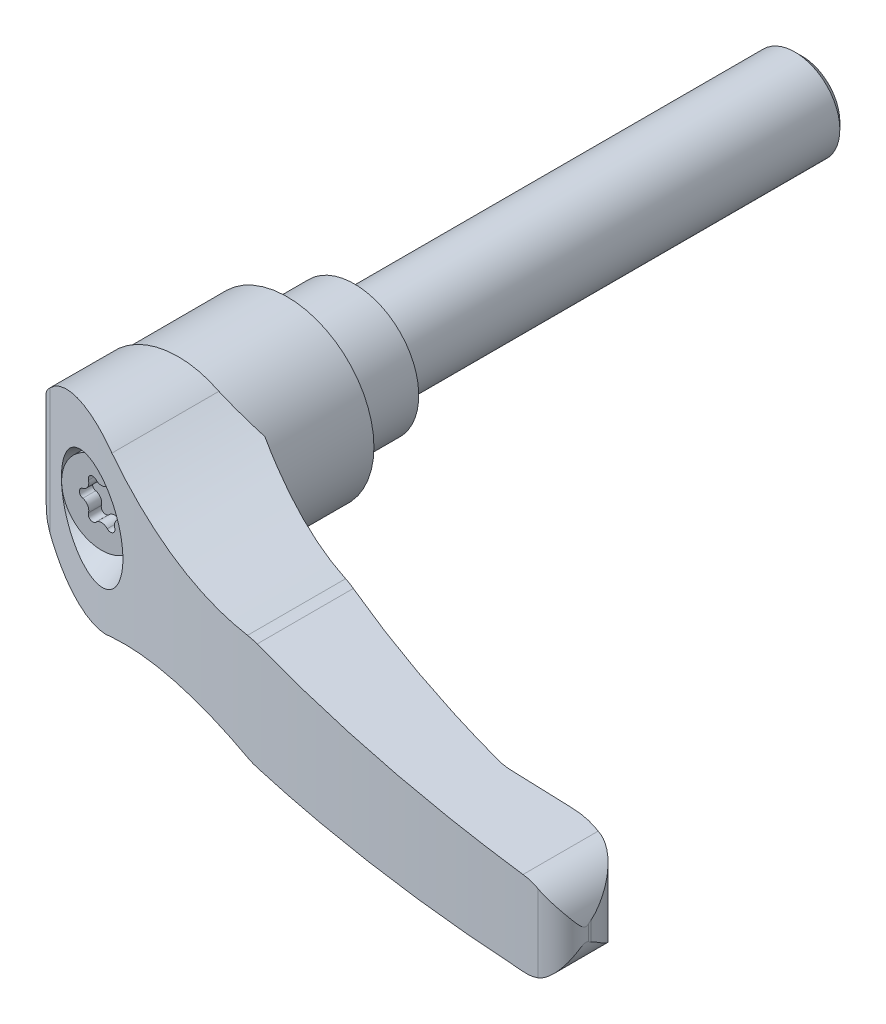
ISO-10303-21;
HEADER;
FILE_DESCRIPTION(('STEP AP214'),'2;1');
FILE_NAME('part.step','',(''),(''),'','','');
FILE_SCHEMA(('AUTOMOTIVE_DESIGN { 1 0 10303 214 1 1 1 1 }'));
ENDSEC;
DATA;
#1=APPLICATION_CONTEXT('core data for automotive mechanical design processes');
#2=APPLICATION_PROTOCOL_DEFINITION('international standard','automotive_design',2000,#1);
#3=PRODUCT_CONTEXT('',#1,'mechanical');
#4=PRODUCT('Part','Part','',(#3));
#5=PRODUCT_RELATED_PRODUCT_CATEGORY('part','',(#4));
#6=PRODUCT_DEFINITION_FORMATION('','',#4);
#7=PRODUCT_DEFINITION_CONTEXT('part definition',#1,'design');
#8=PRODUCT_DEFINITION('design','',#6,#7);
#9=PRODUCT_DEFINITION_SHAPE('','',#8);
#10=(LENGTH_UNIT() NAMED_UNIT(*) SI_UNIT(.MILLI.,.METRE.));
#11=(NAMED_UNIT(*) PLANE_ANGLE_UNIT() SI_UNIT($,.RADIAN.));
#12=(NAMED_UNIT(*) SI_UNIT($,.STERADIAN.) SOLID_ANGLE_UNIT());
#13=UNCERTAINTY_MEASURE_WITH_UNIT(LENGTH_MEASURE(1.E-05),#10,'distance_accuracy_value','');
#14=(GEOMETRIC_REPRESENTATION_CONTEXT(3) GLOBAL_UNCERTAINTY_ASSIGNED_CONTEXT((#13)) GLOBAL_UNIT_ASSIGNED_CONTEXT((#10,
#11,#12)) REPRESENTATION_CONTEXT('',''));
#15=CARTESIAN_POINT('',(0.,0.,0.));
#16=DIRECTION('',(0.,0.,1.));
#17=DIRECTION('',(1.,0.,0.));
#18=AXIS2_PLACEMENT_3D('',#15,#16,#17);
#19=CARTESIAN_POINT('',(6.77133,0.,-80.));
#20=DIRECTION('',(0.,0.,-1.));
#21=DIRECTION('',(0.,1.,0.));
#22=AXIS2_PLACEMENT_3D('',#19,#20,#21);
#23=PLANE('',#22);
#24=CARTESIAN_POINT('',(0.,0.,-80.));
#25=DIRECTION('',(0.,0.,1.));
#26=DIRECTION('',(0.,-1.,0.));
#27=AXIS2_PLACEMENT_3D('',#24,#25,#26);
#28=CIRCLE('',#27,6.77133);
#29=CARTESIAN_POINT('',(0.,-6.77133,-80.));
#30=VERTEX_POINT('',#29);
#31=EDGE_CURVE('E346',#30,#30,#28,.T.);
#32=ORIENTED_EDGE('',*,*,#31,.F.);
#33=EDGE_LOOP('',(#32));
#34=FACE_BOUND('',#33,.T.);
#35=ADVANCED_FACE('F14',(#34),#23,.T.);
#36=CARTESIAN_POINT('',(0.,0.,-78.77133));
#37=DIRECTION('',(0.,0.,1.));
#38=DIRECTION('',(0.,-1.,0.));
#39=AXIS2_PLACEMENT_3D('',#36,#37,#38);
#40=CONICAL_SURFACE('',#39,8.,0.785398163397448);
#41=ORIENTED_EDGE('',*,*,#31,.T.);
#42=EDGE_LOOP('',(#41));
#43=FACE_BOUND('',#42,.T.);
#44=CARTESIAN_POINT('',(0.,0.,-78.77133));
#45=DIRECTION('',(0.,0.,1.));
#46=DIRECTION('',(0.,-1.,0.));
#47=AXIS2_PLACEMENT_3D('',#44,#45,#46);
#48=CIRCLE('',#47,8.);
#49=CARTESIAN_POINT('',(0.,-8.,-78.77133));
#50=VERTEX_POINT('',#49);
#51=EDGE_CURVE('E349',#50,#50,#48,.T.);
#52=ORIENTED_EDGE('',*,*,#51,.F.);
#53=EDGE_LOOP('',(#52));
#54=FACE_BOUND('',#53,.T.);
#55=ADVANCED_FACE('F696',(#43,#54),#40,.T.);
#56=CARTESIAN_POINT('',(0.,0.,12.));
#57=DIRECTION('',(0.,0.,1.));
#58=DIRECTION('',(0.,-1.,0.));
#59=AXIS2_PLACEMENT_3D('',#56,#57,#58);
#60=CYLINDRICAL_SURFACE('',#59,8.);
#61=ORIENTED_EDGE('',*,*,#51,.T.);
#62=EDGE_LOOP('',(#61));
#63=FACE_BOUND('',#62,.T.);
#64=CARTESIAN_POINT('',(0.,0.,0.));
#65=DIRECTION('',(0.,0.,1.));
#66=DIRECTION('',(0.,-1.,0.));
#67=AXIS2_PLACEMENT_3D('',#64,#65,#66);
#68=CIRCLE('',#67,8.);
#69=CARTESIAN_POINT('',(0.,-8.,0.));
#70=VERTEX_POINT('',#69);
#71=EDGE_CURVE('E352',#70,#70,#68,.T.);
#72=ORIENTED_EDGE('',*,*,#71,.F.);
#73=EDGE_LOOP('',(#72));
#74=FACE_BOUND('',#73,.T.);
#75=ADVANCED_FACE('F700',(#63,#74),#60,.T.);
#76=CARTESIAN_POINT('',(11.5,0.,0.));
#77=DIRECTION('',(0.,0.,-1.));
#78=DIRECTION('',(0.,1.,0.));
#79=AXIS2_PLACEMENT_3D('',#76,#77,#78);
#80=PLANE('',#79);
#81=ORIENTED_EDGE('',*,*,#71,.T.);
#82=EDGE_LOOP('',(#81));
#83=FACE_BOUND('',#82,.T.);
#84=CARTESIAN_POINT('',(0.,0.,0.));
#85=DIRECTION('',(0.,0.,1.));
#86=DIRECTION('',(0.,-1.,0.));
#87=AXIS2_PLACEMENT_3D('',#84,#85,#86);
#88=CIRCLE('',#87,11.5);
#89=CARTESIAN_POINT('',(0.,-11.5,0.));
#90=VERTEX_POINT('',#89);
#91=EDGE_CURVE('E355',#90,#90,#88,.T.);
#92=ORIENTED_EDGE('',*,*,#91,.F.);
#93=EDGE_LOOP('',(#92));
#94=FACE_BOUND('',#93,.T.);
#95=ADVANCED_FACE('F649',(#83,#94),#80,.T.);
#96=CARTESIAN_POINT('',(0.,0.,12.));
#97=DIRECTION('',(0.,0.,1.));
#98=DIRECTION('',(0.,-1.,0.));
#99=AXIS2_PLACEMENT_3D('',#96,#97,#98);
#100=CYLINDRICAL_SURFACE('',#99,11.5);
#101=ORIENTED_EDGE('',*,*,#91,.T.);
#102=EDGE_LOOP('',(#101));
#103=FACE_BOUND('',#102,.T.);
#104=CARTESIAN_POINT('',(0.,0.,12.75));
#105=DIRECTION('',(0.,0.,-1.));
#106=DIRECTION('',(1.,0.,0.));
#107=AXIS2_PLACEMENT_3D('',#104,#105,#106);
#108=CIRCLE('',#107,11.5);
#109=CARTESIAN_POINT('',(11.5,0.,12.75));
#110=VERTEX_POINT('',#109);
#111=EDGE_CURVE('E9',#110,#110,#108,.T.);
#112=ORIENTED_EDGE('',*,*,#111,.T.);
#113=EDGE_LOOP('',(#112));
#114=FACE_BOUND('',#113,.T.);
#115=ADVANCED_FACE('F641',(#103,#114),#100,.T.);
#116=CARTESIAN_POINT('',(7.15,0.,42.87));
#117=DIRECTION('',(0.,0.,-1.));
#118=DIRECTION('',(0.,1.,0.));
#119=AXIS2_PLACEMENT_3D('',#116,#117,#118);
#120=PLANE('',#119);
#121=CARTESIAN_POINT('',(1.59,2.75396078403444,42.87));
#122=DIRECTION('',(0.,0.,-1.));
#123=DIRECTION('',(0.,1.,0.));
#124=AXIS2_PLACEMENT_3D('',#121,#122,#123);
#125=CIRCLE('',#124,0.795000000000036);
#126=CARTESIAN_POINT('',(2.3516351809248,2.5260642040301,42.87));
#127=VERTEX_POINT('',#126);
#128=CARTESIAN_POINT('',(1.0118181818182,3.2996079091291,42.87));
#129=VERTEX_POINT('',#128);
#130=EDGE_CURVE('E327',#127,#129,#125,.F.);
#131=ORIENTED_EDGE('',*,*,#130,.T.);
#132=CARTESIAN_POINT('',(0.,4.25449037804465,42.87));
#133=DIRECTION('',(0.,0.,-1.));
#134=DIRECTION('',(0.,1.,0.));
#135=AXIS2_PLACEMENT_3D('',#132,#133,#134);
#136=CIRCLE('',#135,1.39125000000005);
#137=CARTESIAN_POINT('',(-1.0118181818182,3.2996079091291,42.87));
#138=VERTEX_POINT('',#137);
#139=EDGE_CURVE('E285',#138,#129,#136,.F.);
#140=ORIENTED_EDGE('',*,*,#139,.F.);
#141=CARTESIAN_POINT('',(-1.58999999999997,2.75396078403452,42.87));
#142=DIRECTION('',(0.,0.,-1.));
#143=DIRECTION('',(0.,1.,0.));
#144=AXIS2_PLACEMENT_3D('',#141,#142,#143);
#145=CIRCLE('',#144,0.794999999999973);
#146=CARTESIAN_POINT('',(-2.3516351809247,2.5260642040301,42.87));
#147=VERTEX_POINT('',#146);
#148=EDGE_CURVE('E324',#138,#147,#145,.F.);
#149=ORIENTED_EDGE('',*,*,#148,.T.);
#150=CARTESIAN_POINT('',(-3.68449674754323,2.12724518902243,42.87));
#151=DIRECTION('',(0.,0.,-1.));
#152=DIRECTION('',(0.,1.,0.));
#153=AXIS2_PLACEMENT_3D('',#150,#151,#152);
#154=CIRCLE('',#153,1.39125000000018);
#155=CARTESIAN_POINT('',(-3.3634533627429,0.77354370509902,42.87));
#156=VERTEX_POINT('',#155);
#157=EDGE_CURVE('E280',#156,#147,#154,.F.);
#158=ORIENTED_EDGE('',*,*,#157,.F.);
#159=CARTESIAN_POINT('',(-3.18,0.,42.87));
#160=DIRECTION('',(0.,0.,-1.));
#161=DIRECTION('',(0.,1.,0.));
#162=AXIS2_PLACEMENT_3D('',#159,#160,#161);
#163=CIRCLE('',#162,0.795);
#164=CARTESIAN_POINT('',(-3.3634533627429,-0.77354370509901,42.87));
#165=VERTEX_POINT('',#164);
#166=EDGE_CURVE('E38',#156,#165,#163,.F.);
#167=ORIENTED_EDGE('',*,*,#166,.T.);
#168=CARTESIAN_POINT('',(-3.68449674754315,-2.12724518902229,42.87));
#169=DIRECTION('',(0.,0.,-1.));
#170=DIRECTION('',(0.,1.,0.));
#171=AXIS2_PLACEMENT_3D('',#168,#169,#170);
#172=CIRCLE('',#171,1.39125000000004);
#173=CARTESIAN_POINT('',(-2.3516351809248,-2.5260642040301,42.87));
#174=VERTEX_POINT('',#173);
#175=EDGE_CURVE('E272',#174,#165,#172,.F.);
#176=ORIENTED_EDGE('',*,*,#175,.F.);
#177=CARTESIAN_POINT('',(-1.59,-2.75396078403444,42.87));
#178=DIRECTION('',(0.,0.,-1.));
#179=DIRECTION('',(0.,1.,0.));
#180=AXIS2_PLACEMENT_3D('',#177,#178,#179);
#181=CIRCLE('',#180,0.795000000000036);
#182=CARTESIAN_POINT('',(-1.0118181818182,-3.2996079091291,42.87));
#183=VERTEX_POINT('',#182);
#184=EDGE_CURVE('E254',#174,#183,#181,.F.);
#185=ORIENTED_EDGE('',*,*,#184,.T.);
#186=CARTESIAN_POINT('',(0.,-4.25449037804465,42.87));
#187=DIRECTION('',(0.,0.,-1.));
#188=DIRECTION('',(0.,1.,0.));
#189=AXIS2_PLACEMENT_3D('',#186,#187,#188);
#190=CIRCLE('',#189,1.39125000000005);
#191=CARTESIAN_POINT('',(1.0118181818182,-3.2996079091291,42.87));
#192=VERTEX_POINT('',#191);
#193=EDGE_CURVE('E279',#192,#183,#190,.F.);
#194=ORIENTED_EDGE('',*,*,#193,.F.);
#195=CARTESIAN_POINT('',(1.58999999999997,-2.75396078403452,42.87));
#196=DIRECTION('',(0.,0.,-1.));
#197=DIRECTION('',(0.,1.,0.));
#198=AXIS2_PLACEMENT_3D('',#195,#196,#197);
#199=CIRCLE('',#198,0.794999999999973);
#200=CARTESIAN_POINT('',(2.3516351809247,-2.5260642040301,42.87));
#201=VERTEX_POINT('',#200);
#202=EDGE_CURVE('E337',#192,#201,#199,.F.);
#203=ORIENTED_EDGE('',*,*,#202,.T.);
#204=CARTESIAN_POINT('',(3.68449674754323,-2.12724518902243,42.87));
#205=DIRECTION('',(0.,0.,-1.));
#206=DIRECTION('',(0.,1.,0.));
#207=AXIS2_PLACEMENT_3D('',#204,#205,#206);
#208=CIRCLE('',#207,1.39125000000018);
#209=CARTESIAN_POINT('',(3.3634533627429,-0.77354370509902,42.87));
#210=VERTEX_POINT('',#209);
#211=EDGE_CURVE('E282',#210,#201,#208,.F.);
#212=ORIENTED_EDGE('',*,*,#211,.F.);
#213=CARTESIAN_POINT('',(3.18,0.,42.87));
#214=DIRECTION('',(0.,0.,-1.));
#215=DIRECTION('',(0.,1.,0.));
#216=AXIS2_PLACEMENT_3D('',#213,#214,#215);
#217=CIRCLE('',#216,0.795);
#218=CARTESIAN_POINT('',(3.3634533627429,0.77354370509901,42.87));
#219=VERTEX_POINT('',#218);
#220=EDGE_CURVE('E332',#210,#219,#217,.F.);
#221=ORIENTED_EDGE('',*,*,#220,.T.);
#222=CARTESIAN_POINT('',(3.68449674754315,2.12724518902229,42.87));
#223=DIRECTION('',(0.,0.,-1.));
#224=DIRECTION('',(0.,1.,0.));
#225=AXIS2_PLACEMENT_3D('',#222,#223,#224);
#226=CIRCLE('',#225,1.39125000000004);
#227=EDGE_CURVE('E291',#127,#219,#226,.F.);
#228=ORIENTED_EDGE('',*,*,#227,.F.);
#229=EDGE_LOOP('',(#131,#140,#149,#158,#167,#176,#185,#194,#203,#212,#221,#228));
#230=FACE_BOUND('',#229,.T.);
#231=ADVANCED_FACE('F277',(#230),#120,.F.);
#232=CARTESIAN_POINT('',(-3.68449674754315,-2.12724518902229,49.24));
#233=DIRECTION('',(0.,0.,-1.));
#234=DIRECTION('',(0.,1.,0.));
#235=AXIS2_PLACEMENT_3D('',#232,#233,#234);
#236=CYLINDRICAL_SURFACE('',#235,1.39125000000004);
#237=DIRECTION('',(0.,0.,-1.));
#238=VECTOR('',#237,1.);
#239=CARTESIAN_POINT('',(-2.3516351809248,-2.5260642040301,49.24));
#240=LINE('',#239,#238);
#241=CARTESIAN_POINT('',(-2.3516351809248,-2.5260642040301,45.19));
#242=VERTEX_POINT('',#241);
#243=EDGE_CURVE('E257',#242,#174,#240,.T.);
#244=ORIENTED_EDGE('',*,*,#243,.T.);
#245=ORIENTED_EDGE('',*,*,#175,.T.);
#246=DIRECTION('',(0.,0.,-1.));
#247=VECTOR('',#246,1.);
#248=CARTESIAN_POINT('',(-3.3634533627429,-0.77354370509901,49.24));
#249=LINE('',#248,#247);
#250=CARTESIAN_POINT('',(-3.3634533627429,-0.77354370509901,45.19));
#251=VERTEX_POINT('',#250);
#252=EDGE_CURVE('E275',#251,#165,#249,.T.);
#253=ORIENTED_EDGE('',*,*,#252,.F.);
#254=CARTESIAN_POINT('',(-3.68449674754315,-2.12724518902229,45.19));
#255=DIRECTION('',(0.,0.,1.));
#256=DIRECTION('',(0.,-1.,0.));
#257=AXIS2_PLACEMENT_3D('',#254,#255,#256);
#258=CIRCLE('',#257,1.39125000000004);
#259=EDGE_CURVE('E274',#242,#251,#258,.T.);
#260=ORIENTED_EDGE('',*,*,#259,.F.);
#261=EDGE_LOOP('',(#244,#245,#253,#260));
#262=FACE_BOUND('',#261,.T.);
#263=ADVANCED_FACE('F270',(#262),#236,.T.);
#264=CARTESIAN_POINT('',(-1.59,-2.75396078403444,49.24));
#265=DIRECTION('',(0.,0.,-1.));
#266=DIRECTION('',(0.,1.,0.));
#267=AXIS2_PLACEMENT_3D('',#264,#265,#266);
#268=CYLINDRICAL_SURFACE('',#267,0.795000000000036);
#269=DIRECTION('',(0.,0.,-1.));
#270=VECTOR('',#269,1.);
#271=CARTESIAN_POINT('',(-1.0118181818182,-3.2996079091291,49.24));
#272=LINE('',#271,#270);
#273=CARTESIAN_POINT('',(-1.0118181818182,-3.2996079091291,45.19));
#274=VERTEX_POINT('',#273);
#275=EDGE_CURVE('E260',#274,#183,#272,.T.);
#276=ORIENTED_EDGE('',*,*,#275,.T.);
#277=ORIENTED_EDGE('',*,*,#184,.F.);
#278=ORIENTED_EDGE('',*,*,#243,.F.);
#279=CARTESIAN_POINT('',(-1.59,-2.75396078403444,45.19));
#280=DIRECTION('',(0.,0.,1.));
#281=DIRECTION('',(0.,-1.,0.));
#282=AXIS2_PLACEMENT_3D('',#279,#280,#281);
#283=CIRCLE('',#282,0.795000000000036);
#284=EDGE_CURVE('E265',#274,#242,#283,.F.);
#285=ORIENTED_EDGE('',*,*,#284,.F.);
#286=EDGE_LOOP('',(#276,#277,#278,#285));
#287=FACE_BOUND('',#286,.T.);
#288=ADVANCED_FACE('F256',(#287),#268,.F.);
#289=CARTESIAN_POINT('',(0.,-4.25449037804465,49.24));
#290=DIRECTION('',(0.,0.,-1.));
#291=DIRECTION('',(0.,1.,0.));
#292=AXIS2_PLACEMENT_3D('',#289,#290,#291);
#293=CYLINDRICAL_SURFACE('',#292,1.39125000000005);
#294=DIRECTION('',(0.,0.,-1.));
#295=VECTOR('',#294,1.);
#296=CARTESIAN_POINT('',(1.0118181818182,-3.2996079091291,49.24));
#297=LINE('',#296,#295);
#298=CARTESIAN_POINT('',(1.0118181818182,-3.2996079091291,45.19));
#299=VERTEX_POINT('',#298);
#300=EDGE_CURVE('E317',#299,#192,#297,.T.);
#301=ORIENTED_EDGE('',*,*,#300,.T.);
#302=ORIENTED_EDGE('',*,*,#193,.T.);
#303=ORIENTED_EDGE('',*,*,#275,.F.);
#304=CARTESIAN_POINT('',(0.,-4.25449037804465,45.19));
#305=DIRECTION('',(0.,0.,1.));
#306=DIRECTION('',(0.,-1.,0.));
#307=AXIS2_PLACEMENT_3D('',#304,#305,#306);
#308=CIRCLE('',#307,1.39125000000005);
#309=EDGE_CURVE('E370',#299,#274,#308,.T.);
#310=ORIENTED_EDGE('',*,*,#309,.F.);
#311=EDGE_LOOP('',(#301,#302,#303,#310));
#312=FACE_BOUND('',#311,.T.);
#313=ADVANCED_FACE('F680',(#312),#293,.T.);
#314=CARTESIAN_POINT('',(1.58999999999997,-2.75396078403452,49.24));
#315=DIRECTION('',(0.,0.,-1.));
#316=DIRECTION('',(0.,1.,0.));
#317=AXIS2_PLACEMENT_3D('',#314,#315,#316);
#318=CYLINDRICAL_SURFACE('',#317,0.794999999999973);
#319=DIRECTION('',(0.,0.,-1.));
#320=VECTOR('',#319,1.);
#321=CARTESIAN_POINT('',(2.3516351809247,-2.5260642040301,49.24));
#322=LINE('',#321,#320);
#323=CARTESIAN_POINT('',(2.3516351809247,-2.5260642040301,45.19));
#324=VERTEX_POINT('',#323);
#325=EDGE_CURVE('E314',#324,#201,#322,.T.);
#326=ORIENTED_EDGE('',*,*,#325,.T.);
#327=ORIENTED_EDGE('',*,*,#202,.F.);
#328=ORIENTED_EDGE('',*,*,#300,.F.);
#329=CARTESIAN_POINT('',(1.58999999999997,-2.75396078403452,45.19));
#330=DIRECTION('',(0.,0.,1.));
#331=DIRECTION('',(0.,-1.,0.));
#332=AXIS2_PLACEMENT_3D('',#329,#330,#331);
#333=CIRCLE('',#332,0.794999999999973);
#334=EDGE_CURVE('E266',#324,#299,#333,.F.);
#335=ORIENTED_EDGE('',*,*,#334,.F.);
#336=EDGE_LOOP('',(#326,#327,#328,#335));
#337=FACE_BOUND('',#336,.T.);
#338=ADVANCED_FACE('F676',(#337),#318,.F.);
#339=CARTESIAN_POINT('',(3.68449674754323,-2.12724518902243,49.24));
#340=DIRECTION('',(0.,0.,-1.));
#341=DIRECTION('',(0.,1.,0.));
#342=AXIS2_PLACEMENT_3D('',#339,#340,#341);
#343=CYLINDRICAL_SURFACE('',#342,1.39125000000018);
#344=DIRECTION('',(0.,0.,-1.));
#345=VECTOR('',#344,1.);
#346=CARTESIAN_POINT('',(3.3634533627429,-0.77354370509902,49.24));
#347=LINE('',#346,#345);
#348=CARTESIAN_POINT('',(3.3634533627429,-0.77354370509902,45.19));
#349=VERTEX_POINT('',#348);
#350=EDGE_CURVE('E311',#349,#210,#347,.T.);
#351=ORIENTED_EDGE('',*,*,#350,.T.);
#352=ORIENTED_EDGE('',*,*,#211,.T.);
#353=ORIENTED_EDGE('',*,*,#325,.F.);
#354=CARTESIAN_POINT('',(3.68449674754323,-2.12724518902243,45.19));
#355=DIRECTION('',(0.,0.,1.));
#356=DIRECTION('',(0.,-1.,0.));
#357=AXIS2_PLACEMENT_3D('',#354,#355,#356);
#358=CIRCLE('',#357,1.39125000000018);
#359=EDGE_CURVE('E367',#349,#324,#358,.T.);
#360=ORIENTED_EDGE('',*,*,#359,.F.);
#361=EDGE_LOOP('',(#351,#352,#353,#360));
#362=FACE_BOUND('',#361,.T.);
#363=ADVANCED_FACE('F672',(#362),#343,.T.);
#364=CARTESIAN_POINT('',(3.18,0.,49.24));
#365=DIRECTION('',(0.,0.,-1.));
#366=DIRECTION('',(0.,1.,0.));
#367=AXIS2_PLACEMENT_3D('',#364,#365,#366);
#368=CYLINDRICAL_SURFACE('',#367,0.795);
#369=DIRECTION('',(0.,0.,-1.));
#370=VECTOR('',#369,1.);
#371=CARTESIAN_POINT('',(3.3634533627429,0.77354370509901,49.24));
#372=LINE('',#371,#370);
#373=CARTESIAN_POINT('',(3.3634533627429,0.77354370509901,45.19));
#374=VERTEX_POINT('',#373);
#375=EDGE_CURVE('E308',#374,#219,#372,.T.);
#376=ORIENTED_EDGE('',*,*,#375,.T.);
#377=ORIENTED_EDGE('',*,*,#220,.F.);
#378=ORIENTED_EDGE('',*,*,#350,.F.);
#379=CARTESIAN_POINT('',(3.18,0.,45.19));
#380=DIRECTION('',(0.,0.,1.));
#381=DIRECTION('',(0.,-1.,0.));
#382=AXIS2_PLACEMENT_3D('',#379,#380,#381);
#383=CIRCLE('',#382,0.795);
#384=EDGE_CURVE('E334',#374,#349,#383,.F.);
#385=ORIENTED_EDGE('',*,*,#384,.F.);
#386=EDGE_LOOP('',(#376,#377,#378,#385));
#387=FACE_BOUND('',#386,.T.);
#388=ADVANCED_FACE('F668',(#387),#368,.F.);
#389=CARTESIAN_POINT('',(3.68449674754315,2.12724518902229,49.24));
#390=DIRECTION('',(0.,0.,-1.));
#391=DIRECTION('',(0.,1.,0.));
#392=AXIS2_PLACEMENT_3D('',#389,#390,#391);
#393=CYLINDRICAL_SURFACE('',#392,1.39125000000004);
#394=DIRECTION('',(0.,0.,-1.));
#395=VECTOR('',#394,1.);
#396=CARTESIAN_POINT('',(2.3516351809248,2.5260642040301,49.24));
#397=LINE('',#396,#395);
#398=CARTESIAN_POINT('',(2.3516351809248,2.5260642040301,45.19));
#399=VERTEX_POINT('',#398);
#400=EDGE_CURVE('E305',#399,#127,#397,.T.);
#401=ORIENTED_EDGE('',*,*,#400,.T.);
#402=ORIENTED_EDGE('',*,*,#227,.T.);
#403=ORIENTED_EDGE('',*,*,#375,.F.);
#404=CARTESIAN_POINT('',(3.68449674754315,2.12724518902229,45.19));
#405=DIRECTION('',(0.,0.,1.));
#406=DIRECTION('',(0.,-1.,0.));
#407=AXIS2_PLACEMENT_3D('',#404,#405,#406);
#408=CIRCLE('',#407,1.39125000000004);
#409=EDGE_CURVE('E364',#399,#374,#408,.T.);
#410=ORIENTED_EDGE('',*,*,#409,.F.);
#411=EDGE_LOOP('',(#401,#402,#403,#410));
#412=FACE_BOUND('',#411,.T.);
#413=ADVANCED_FACE('F664',(#412),#393,.T.);
#414=CARTESIAN_POINT('',(1.59,2.75396078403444,49.24));
#415=DIRECTION('',(0.,0.,-1.));
#416=DIRECTION('',(0.,1.,0.));
#417=AXIS2_PLACEMENT_3D('',#414,#415,#416);
#418=CYLINDRICAL_SURFACE('',#417,0.795000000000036);
#419=ORIENTED_EDGE('',*,*,#130,.F.);
#420=ORIENTED_EDGE('',*,*,#400,.F.);
#421=CARTESIAN_POINT('',(1.59,2.75396078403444,45.19));
#422=DIRECTION('',(0.,0.,1.));
#423=DIRECTION('',(0.,-1.,0.));
#424=AXIS2_PLACEMENT_3D('',#421,#422,#423);
#425=CIRCLE('',#424,0.795000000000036);
#426=CARTESIAN_POINT('',(1.0118181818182,3.2996079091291,45.19));
#427=VERTEX_POINT('',#426);
#428=EDGE_CURVE('E329',#427,#399,#425,.F.);
#429=ORIENTED_EDGE('',*,*,#428,.F.);
#430=DIRECTION('',(0.,0.,-1.));
#431=VECTOR('',#430,1.);
#432=CARTESIAN_POINT('',(1.0118181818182,3.2996079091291,49.24));
#433=LINE('',#432,#431);
#434=EDGE_CURVE('E302',#427,#129,#433,.T.);
#435=ORIENTED_EDGE('',*,*,#434,.T.);
#436=EDGE_LOOP('',(#419,#420,#429,#435));
#437=FACE_BOUND('',#436,.T.);
#438=ADVANCED_FACE('F660',(#437),#418,.F.);
#439=CARTESIAN_POINT('',(0.,4.25449037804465,49.24));
#440=DIRECTION('',(0.,0.,-1.));
#441=DIRECTION('',(0.,1.,0.));
#442=AXIS2_PLACEMENT_3D('',#439,#440,#441);
#443=CYLINDRICAL_SURFACE('',#442,1.39125000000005);
#444=DIRECTION('',(0.,0.,-1.));
#445=VECTOR('',#444,1.);
#446=CARTESIAN_POINT('',(-1.0118181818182,3.2996079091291,49.24));
#447=LINE('',#446,#445);
#448=CARTESIAN_POINT('',(-1.0118181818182,3.2996079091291,45.19));
#449=VERTEX_POINT('',#448);
#450=EDGE_CURVE('E299',#449,#138,#447,.T.);
#451=ORIENTED_EDGE('',*,*,#450,.T.);
#452=ORIENTED_EDGE('',*,*,#139,.T.);
#453=ORIENTED_EDGE('',*,*,#434,.F.);
#454=CARTESIAN_POINT('',(0.,4.25449037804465,45.19));
#455=DIRECTION('',(0.,0.,1.));
#456=DIRECTION('',(0.,-1.,0.));
#457=AXIS2_PLACEMENT_3D('',#454,#455,#456);
#458=CIRCLE('',#457,1.39125000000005);
#459=EDGE_CURVE('E361',#449,#427,#458,.T.);
#460=ORIENTED_EDGE('',*,*,#459,.F.);
#461=EDGE_LOOP('',(#451,#452,#453,#460));
#462=FACE_BOUND('',#461,.T.);
#463=ADVANCED_FACE('F657',(#462),#443,.T.);
#464=CARTESIAN_POINT('',(-1.58999999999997,2.75396078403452,49.24));
#465=DIRECTION('',(0.,0.,-1.));
#466=DIRECTION('',(0.,1.,0.));
#467=AXIS2_PLACEMENT_3D('',#464,#465,#466);
#468=CYLINDRICAL_SURFACE('',#467,0.794999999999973);
#469=ORIENTED_EDGE('',*,*,#148,.F.);
#470=ORIENTED_EDGE('',*,*,#450,.F.);
#471=CARTESIAN_POINT('',(-1.58999999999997,2.75396078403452,45.19));
#472=DIRECTION('',(0.,0.,1.));
#473=DIRECTION('',(0.,-1.,0.));
#474=AXIS2_PLACEMENT_3D('',#471,#472,#473);
#475=CIRCLE('',#474,0.794999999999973);
#476=CARTESIAN_POINT('',(-2.3516351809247,2.5260642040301,45.19));
#477=VERTEX_POINT('',#476);
#478=EDGE_CURVE('E190',#477,#449,#475,.F.);
#479=ORIENTED_EDGE('',*,*,#478,.F.);
#480=DIRECTION('',(0.,0.,-1.));
#481=VECTOR('',#480,1.);
#482=CARTESIAN_POINT('',(-2.3516351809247,2.5260642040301,49.24));
#483=LINE('',#482,#481);
#484=EDGE_CURVE('E297',#477,#147,#483,.T.);
#485=ORIENTED_EDGE('',*,*,#484,.T.);
#486=EDGE_LOOP('',(#469,#470,#479,#485));
#487=FACE_BOUND('',#486,.T.);
#488=ADVANCED_FACE('F653',(#487),#468,.F.);
#489=CARTESIAN_POINT('',(-3.68449674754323,2.12724518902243,49.24));
#490=DIRECTION('',(0.,0.,-1.));
#491=DIRECTION('',(0.,1.,0.));
#492=AXIS2_PLACEMENT_3D('',#489,#490,#491);
#493=CYLINDRICAL_SURFACE('',#492,1.39125000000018);
#494=DIRECTION('',(0.,0.,-1.));
#495=VECTOR('',#494,1.);
#496=CARTESIAN_POINT('',(-3.3634533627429,0.77354370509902,49.24));
#497=LINE('',#496,#495);
#498=CARTESIAN_POINT('',(-3.3634533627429,0.77354370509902,45.19));
#499=VERTEX_POINT('',#498);
#500=EDGE_CURVE('E322',#499,#156,#497,.T.);
#501=ORIENTED_EDGE('',*,*,#500,.T.);
#502=ORIENTED_EDGE('',*,*,#157,.T.);
#503=ORIENTED_EDGE('',*,*,#484,.F.);
#504=CARTESIAN_POINT('',(-3.68449674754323,2.12724518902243,45.19));
#505=DIRECTION('',(0.,0.,1.));
#506=DIRECTION('',(0.,-1.,0.));
#507=AXIS2_PLACEMENT_3D('',#504,#505,#506);
#508=CIRCLE('',#507,1.39125000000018);
#509=EDGE_CURVE('E29',#499,#477,#508,.T.);
#510=ORIENTED_EDGE('',*,*,#509,.F.);
#511=EDGE_LOOP('',(#501,#502,#503,#510));
#512=FACE_BOUND('',#511,.T.);
#513=ADVANCED_FACE('F656',(#512),#493,.T.);
#514=CARTESIAN_POINT('',(-3.18,0.,49.24));
#515=DIRECTION('',(0.,0.,-1.));
#516=DIRECTION('',(0.,1.,0.));
#517=AXIS2_PLACEMENT_3D('',#514,#515,#516);
#518=CYLINDRICAL_SURFACE('',#517,0.795);
#519=ORIENTED_EDGE('',*,*,#252,.T.);
#520=ORIENTED_EDGE('',*,*,#166,.F.);
#521=ORIENTED_EDGE('',*,*,#500,.F.);
#522=CARTESIAN_POINT('',(-3.18,0.,45.19));
#523=DIRECTION('',(0.,0.,1.));
#524=DIRECTION('',(0.,-1.,0.));
#525=AXIS2_PLACEMENT_3D('',#522,#523,#524);
#526=CIRCLE('',#525,0.795);
#527=EDGE_CURVE('E343',#251,#499,#526,.F.);
#528=ORIENTED_EDGE('',*,*,#527,.F.);
#529=EDGE_LOOP('',(#519,#520,#521,#528));
#530=FACE_BOUND('',#529,.T.);
#531=ADVANCED_FACE('F687',(#530),#518,.F.);
#532=CARTESIAN_POINT('',(0.,0.,45.19));
#533=DIRECTION('',(0.,0.,1.));
#534=DIRECTION('',(0.,-1.,0.));
#535=AXIS2_PLACEMENT_3D('',#532,#533,#534);
#536=PLANE('',#535);
#537=CARTESIAN_POINT('',(0.,0.,45.19));
#538=DIRECTION('',(0.,0.,1.));
#539=DIRECTION('',(0.,-1.,0.));
#540=AXIS2_PLACEMENT_3D('',#537,#538,#539);
#541=CIRCLE('',#540,7.15);
#542=CARTESIAN_POINT('',(0.,-7.15,45.19));
#543=VERTEX_POINT('',#542);
#544=EDGE_CURVE('E358',#543,#543,#541,.T.);
#545=ORIENTED_EDGE('',*,*,#544,.T.);
#546=EDGE_LOOP('',(#545));
#547=FACE_BOUND('',#546,.T.);
#548=ORIENTED_EDGE('',*,*,#527,.T.);
#549=ORIENTED_EDGE('',*,*,#509,.T.);
#550=ORIENTED_EDGE('',*,*,#478,.T.);
#551=ORIENTED_EDGE('',*,*,#459,.T.);
#552=ORIENTED_EDGE('',*,*,#428,.T.);
#553=ORIENTED_EDGE('',*,*,#409,.T.);
#554=ORIENTED_EDGE('',*,*,#384,.T.);
#555=ORIENTED_EDGE('',*,*,#359,.T.);
#556=ORIENTED_EDGE('',*,*,#334,.T.);
#557=ORIENTED_EDGE('',*,*,#309,.T.);
#558=ORIENTED_EDGE('',*,*,#284,.T.);
#559=ORIENTED_EDGE('',*,*,#259,.T.);
#560=EDGE_LOOP('',(#548,#549,#550,#551,#552,#553,#554,#555,#556,#557,#558,#559));
#561=FACE_BOUND('',#560,.T.);
#562=ADVANCED_FACE('F690',(#547,#561),#536,.T.);
#563=CARTESIAN_POINT('',(0.,0.,12.));
#564=DIRECTION('',(0.,0.,1.));
#565=DIRECTION('',(0.,-1.,0.));
#566=AXIS2_PLACEMENT_3D('',#563,#564,#565);
#567=CYLINDRICAL_SURFACE('',#566,7.15);
#568=CARTESIAN_POINT('',(0.,0.,42.87));
#569=DIRECTION('',(0.,0.,-1.));
#570=DIRECTION('',(0.,1.,0.));
#571=AXIS2_PLACEMENT_3D('',#568,#569,#570);
#572=CIRCLE('',#571,7.15);
#573=CARTESIAN_POINT('',(0.,7.15,42.87));
#574=VERTEX_POINT('',#573);
#575=EDGE_CURVE('E294',#574,#574,#572,.F.);
#576=ORIENTED_EDGE('',*,*,#575,.T.);
#577=EDGE_LOOP('',(#576));
#578=FACE_BOUND('',#577,.T.);
#579=ORIENTED_EDGE('',*,*,#544,.F.);
#580=EDGE_LOOP('',(#579));
#581=FACE_BOUND('',#580,.T.);
#582=ADVANCED_FACE('F471',(#578,#581),#567,.T.);
#583=CARTESIAN_POINT('',(-0.010000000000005,0.,36.6875));
#584=DIRECTION('',(0.,0.,-1.));
#585=DIRECTION('',(1.,0.,0.));
#586=AXIS2_PLACEMENT_3D('',#583,#584,#585);
#587=CYLINDRICAL_SURFACE('',#586,15.5);
#588=CARTESIAN_POINT('',(-0.0100000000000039,0.,31.5));
#589=DIRECTION('',(0.,0.,1.));
#590=DIRECTION('',(0.,-1.,0.));
#591=AXIS2_PLACEMENT_3D('',#588,#589,#590);
#592=CIRCLE('',#591,15.5);
#593=CARTESIAN_POINT('',(-15.51,0.,31.5));
#594=VERTEX_POINT('',#593);
#595=CARTESIAN_POINT('',(15.49,0.,31.5));
#596=VERTEX_POINT('',#595);
#597=EDGE_CURVE('E730',#594,#596,#592,.T.);
#598=ORIENTED_EDGE('',*,*,#597,.F.);
#599=EDGE_CURVE('E734',#596,#594,#592,.T.);
#600=ORIENTED_EDGE('',*,*,#599,.F.);
#601=EDGE_LOOP('',(#598,#600));
#602=FACE_BOUND('',#601,.T.);
#603=CARTESIAN_POINT('',(-0.00999999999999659,0.,-3.250037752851));
#604=DIRECTION('',(0.707106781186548,0.,0.707106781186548));
#605=DIRECTION('',(0.707106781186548,0.,-0.707106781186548));
#606=AXIS2_PLACEMENT_3D('',#603,#604,#605);
#607=ELLIPSE('',#606,21.920310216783,15.5);
#608=CARTESIAN_POINT('',(-15.260037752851,-2.77242647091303,12.));
#609=VERTEX_POINT('',#608);
#610=CARTESIAN_POINT('',(-15.260037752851,2.77242647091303,12.));
#611=VERTEX_POINT('',#610);
#612=EDGE_CURVE('E382',#609,#611,#607,.F.);
#613=ORIENTED_EDGE('',*,*,#612,.F.);
#614=CARTESIAN_POINT('',(-0.0099999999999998,0.,12.));
#615=DIRECTION('',(0.,0.,-1.));
#616=DIRECTION('',(1.,0.,0.));
#617=AXIS2_PLACEMENT_3D('',#614,#615,#616);
#618=CIRCLE('',#617,15.5);
#619=EDGE_CURVE('E181',#611,#609,#618,.T.);
#620=ORIENTED_EDGE('',*,*,#619,.F.);
#621=EDGE_LOOP('',(#613,#620));
#622=FACE_BOUND('',#621,.T.);
#623=ADVANCED_FACE('F462',(#602,#622),#587,.T.);
#624=CARTESIAN_POINT('',(-15.51,-32.,12.249962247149));
#625=DIRECTION('',(0.707106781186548,0.,0.707106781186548));
#626=DIRECTION('',(-0.707106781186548,0.,0.707106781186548));
#627=AXIS2_PLACEMENT_3D('',#624,#625,#626);
#628=PLANE('',#627);
#629=ORIENTED_EDGE('',*,*,#612,.T.);
#630=DIRECTION('',(0.,1.,0.));
#631=VECTOR('',#630,1.);
#632=CARTESIAN_POINT('',(-15.260037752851,-32.,12.));
#633=LINE('',#632,#631);
#634=EDGE_CURVE('E379',#609,#611,#633,.T.);
#635=ORIENTED_EDGE('',*,*,#634,.F.);
#636=EDGE_LOOP('',(#629,#635));
#637=FACE_BOUND('',#636,.T.);
#638=ADVANCED_FACE('F428',(#637),#628,.F.);
#639=CARTESIAN_POINT('',(-0.0099999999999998,0.,12.));
#640=DIRECTION('',(0.,0.,-1.));
#641=DIRECTION('',(1.,0.,0.));
#642=AXIS2_PLACEMENT_3D('',#639,#640,#641);
#643=PLANE('',#642);
#644=CARTESIAN_POINT('',(0.,0.,12.));
#645=DIRECTION('',(0.,0.,-1.));
#646=DIRECTION('',(1.,0.,0.));
#647=AXIS2_PLACEMENT_3D('',#644,#645,#646);
#648=CIRCLE('',#647,11.85);
#649=CARTESIAN_POINT('',(11.85,0.,12.));
#650=VERTEX_POINT('',#649);
#651=EDGE_CURVE('E822',#650,#650,#648,.T.);
#652=ORIENTED_EDGE('',*,*,#651,.F.);
#653=EDGE_LOOP('',(#652));
#654=FACE_BOUND('',#653,.T.);
#655=ORIENTED_EDGE('',*,*,#634,.T.);
#656=ORIENTED_EDGE('',*,*,#619,.T.);
#657=EDGE_LOOP('',(#655,#656));
#658=FACE_BOUND('',#657,.T.);
#659=ADVANCED_FACE('F463',(#654,#658),#643,.T.);
#660=CARTESIAN_POINT('',(0.,0.,12.));
#661=DIRECTION('',(0.,0.,1.));
#662=DIRECTION('',(0.,-1.,0.));
#663=AXIS2_PLACEMENT_3D('',#660,#661,#662);
#664=CYLINDRICAL_SURFACE('',#663,11.85);
#665=ORIENTED_EDGE('',*,*,#651,.T.);
#666=EDGE_LOOP('',(#665));
#667=FACE_BOUND('',#666,.T.);
#668=CARTESIAN_POINT('',(0.,0.,12.4));
#669=DIRECTION('',(0.,0.,1.));
#670=DIRECTION('',(0.,-1.,0.));
#671=AXIS2_PLACEMENT_3D('',#668,#669,#670);
#672=CIRCLE('',#671,11.85);
#673=CARTESIAN_POINT('',(0.,-11.85,12.4));
#674=VERTEX_POINT('',#673);
#675=EDGE_CURVE('E376',#674,#674,#672,.T.);
#676=ORIENTED_EDGE('',*,*,#675,.T.);
#677=EDGE_LOOP('',(#676));
#678=FACE_BOUND('',#677,.T.);
#679=ADVANCED_FACE('F467',(#667,#678),#664,.F.);
#680=CARTESIAN_POINT('',(0.,0.,12.75));
#681=DIRECTION('',(0.,0.,-1.));
#682=DIRECTION('',(0.,1.,0.));
#683=AXIS2_PLACEMENT_3D('',#680,#681,#682);
#684=CONICAL_SURFACE('',#683,11.5,0.78539816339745);
#685=ORIENTED_EDGE('',*,*,#675,.F.);
#686=EDGE_LOOP('',(#685));
#687=FACE_BOUND('',#686,.T.);
#688=ORIENTED_EDGE('',*,*,#111,.F.);
#689=EDGE_LOOP('',(#688));
#690=FACE_BOUND('',#689,.T.);
#691=ADVANCED_FACE('F716',(#687,#690),#684,.F.);
#692=CARTESIAN_POINT('',(-15.51,-17.,31.5));
#693=DIRECTION('',(0.,0.,1.));
#694=DIRECTION('',(0.,-1.,0.));
#695=AXIS2_PLACEMENT_3D('',#692,#693,#694);
#696=PLANE('',#695);
#697=CARTESIAN_POINT('',(33.7499999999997,-76.32,31.5));
#698=DIRECTION('',(0.,0.,1.));
#699=DIRECTION('',(0.,-1.,0.));
#700=AXIS2_PLACEMENT_3D('',#697,#698,#699);
#701=CIRCLE('',#700,67.48);
#702=CARTESIAN_POINT('',(7.274193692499,-14.250828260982,31.5));
#703=VERTEX_POINT('',#702);
#704=CARTESIAN_POINT('',(15.49,-11.3575277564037,31.5));
#705=VERTEX_POINT('',#704);
#706=EDGE_CURVE('E536',#703,#705,#701,.F.);
#707=ORIENTED_EDGE('',*,*,#706,.F.);
#708=CARTESIAN_POINT('',(0.,0.,31.5));
#709=DIRECTION('',(0.,0.,1.));
#710=DIRECTION('',(0.,-1.,0.));
#711=AXIS2_PLACEMENT_3D('',#708,#709,#710);
#712=CIRCLE('',#711,16.);
#713=CARTESIAN_POINT('',(-15.51,-3.92936381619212,31.5));
#714=VERTEX_POINT('',#713);
#715=EDGE_CURVE('E797',#714,#703,#712,.T.);
#716=ORIENTED_EDGE('',*,*,#715,.F.);
#717=DIRECTION('',(0.,1.,0.));
#718=VECTOR('',#717,1.);
#719=CARTESIAN_POINT('',(-15.51,-17.,31.5));
#720=LINE('',#719,#718);
#721=EDGE_CURVE('E770',#714,#594,#720,.T.);
#722=ORIENTED_EDGE('',*,*,#721,.T.);
#723=ORIENTED_EDGE('',*,*,#597,.T.);
#724=DIRECTION('',(0.,1.,0.));
#725=VECTOR('',#724,1.);
#726=CARTESIAN_POINT('',(15.49,-17.,31.5));
#727=LINE('',#726,#725);
#728=EDGE_CURVE('E768',#705,#596,#727,.T.);
#729=ORIENTED_EDGE('',*,*,#728,.F.);
#730=EDGE_LOOP('',(#707,#716,#722,#723,#729));
#731=FACE_BOUND('',#730,.T.);
#732=ADVANCED_FACE('F514',(#731),#696,.F.);
#733=CARTESIAN_POINT('',(-15.51,-17.,36.780322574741));
#734=DIRECTION('',(1.,0.,0.));
#735=DIRECTION('',(0.,1.,0.));
#736=AXIS2_PLACEMENT_3D('',#733,#734,#735);
#737=PLANE('',#736);
#738=DIRECTION('',(0.,0.,1.));
#739=VECTOR('',#738,1.);
#740=CARTESIAN_POINT('',(-15.51,3.92936381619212,0.));
#741=LINE('',#740,#739);
#742=CARTESIAN_POINT('',(-15.51,3.92936381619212,31.5));
#743=VERTEX_POINT('',#742);
#744=CARTESIAN_POINT('',(-15.51,3.92936381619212,36.780322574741));
#745=VERTEX_POINT('',#744);
#746=EDGE_CURVE('E414',#743,#745,#741,.T.);
#747=ORIENTED_EDGE('',*,*,#746,.F.);
#748=EDGE_CURVE('E769',#594,#743,#720,.T.);
#749=ORIENTED_EDGE('',*,*,#748,.F.);
#750=ORIENTED_EDGE('',*,*,#721,.F.);
#751=DIRECTION('',(0.,0.,1.));
#752=VECTOR('',#751,1.);
#753=CARTESIAN_POINT('',(-15.51,-3.92936381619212,0.));
#754=LINE('',#753,#752);
#755=CARTESIAN_POINT('',(-15.51,-3.92936381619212,36.780322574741));
#756=VERTEX_POINT('',#755);
#757=EDGE_CURVE('E791',#756,#714,#754,.F.);
#758=ORIENTED_EDGE('',*,*,#757,.F.);
#759=DIRECTION('',(0.,1.,0.));
#760=VECTOR('',#759,1.);
#761=CARTESIAN_POINT('',(-15.51,-17.,36.780322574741));
#762=LINE('',#761,#760);
#763=EDGE_CURVE('E737',#756,#745,#762,.T.);
#764=ORIENTED_EDGE('',*,*,#763,.T.);
#765=EDGE_LOOP('',(#747,#749,#750,#758,#764));
#766=FACE_BOUND('',#765,.T.);
#767=ADVANCED_FACE('F16',(#766),#737,.F.);
#768=CARTESIAN_POINT('',(33.7499999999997,76.32,31.5));
#769=DIRECTION('',(0.,0.,1.));
#770=DIRECTION('',(0.,-1.,0.));
#771=AXIS2_PLACEMENT_3D('',#768,#769,#770);
#772=CIRCLE('',#771,67.48);
#773=CARTESIAN_POINT('',(15.49,11.3575277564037,31.5));
#774=VERTEX_POINT('',#773);
#775=CARTESIAN_POINT('',(7.274193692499,14.250828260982,31.5));
#776=VERTEX_POINT('',#775);
#777=EDGE_CURVE('E731',#774,#776,#772,.F.);
#778=ORIENTED_EDGE('',*,*,#777,.F.);
#779=EDGE_CURVE('E767',#596,#774,#727,.T.);
#780=ORIENTED_EDGE('',*,*,#779,.F.);
#781=ORIENTED_EDGE('',*,*,#599,.T.);
#782=ORIENTED_EDGE('',*,*,#748,.T.);
#783=CARTESIAN_POINT('',(0.,0.,31.5));
#784=DIRECTION('',(0.,0.,1.));
#785=DIRECTION('',(0.,-1.,0.));
#786=AXIS2_PLACEMENT_3D('',#783,#784,#785);
#787=CIRCLE('',#786,16.);
#788=EDGE_CURVE('E781',#776,#743,#787,.T.);
#789=ORIENTED_EDGE('',*,*,#788,.F.);
#790=EDGE_LOOP('',(#778,#780,#781,#782,#789));
#791=FACE_BOUND('',#790,.T.);
#792=ADVANCED_FACE('F516',(#791),#696,.F.);
#793=CARTESIAN_POINT('',(86.000715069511,-17.,46.1999999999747));
#794=DIRECTION('',(0.,1.,0.));
#795=DIRECTION('',(-1.,0.,0.));
#796=AXIS2_PLACEMENT_3D('',#793,#794,#795);
#797=CYLINDRICAL_SURFACE('',#796,11.6800000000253);
#798=CARTESIAN_POINT('',(86.000715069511,8.0934674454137,46.1999999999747));
#799=DIRECTION('',(0.0359460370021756,0.999353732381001,0.));
#800=DIRECTION('',(-0.999353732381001,0.0359460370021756,0.));
#801=AXIS2_PLACEMENT_3D('',#798,#799,#800);
#802=ELLIPSE('',#801,11.6875532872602,11.6800000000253);
#803=CARTESIAN_POINT('',(86.00071506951,8.09346744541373,57.88));
#804=VERTEX_POINT('',#803);
#805=CARTESIAN_POINT('',(83.209258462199,8.19387413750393,57.541524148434));
#806=VERTEX_POINT('',#805);
#807=EDGE_CURVE('E1399',#804,#806,#802,.F.);
#808=ORIENTED_EDGE('',*,*,#807,.F.);
#809=DIRECTION('',(0.,1.,0.));
#810=VECTOR('',#809,1.);
#811=CARTESIAN_POINT('',(86.00071506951,-17.,57.88));
#812=LINE('',#811,#810);
#813=CARTESIAN_POINT('',(86.00071506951,-8.09346744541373,57.88));
#814=VERTEX_POINT('',#813);
#815=EDGE_CURVE('E761',#814,#804,#812,.T.);
#816=ORIENTED_EDGE('',*,*,#815,.F.);
#817=CARTESIAN_POINT('',(86.000715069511,-8.0934674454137,46.1999999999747));
#818=DIRECTION('',(0.0359460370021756,-0.999353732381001,0.));
#819=DIRECTION('',(0.999353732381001,0.0359460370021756,0.));
#820=AXIS2_PLACEMENT_3D('',#817,#818,#819);
#821=ELLIPSE('',#820,11.6875532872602,11.6800000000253);
#822=CARTESIAN_POINT('',(83.209258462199,-8.19387413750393,57.541524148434));
#823=VERTEX_POINT('',#822);
#824=EDGE_CURVE('E1392',#823,#814,#821,.F.);
#825=ORIENTED_EDGE('',*,*,#824,.F.);
#826=DIRECTION('',(0.,1.,0.));
#827=VECTOR('',#826,1.);
#828=CARTESIAN_POINT('',(83.209258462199,-17.,57.541524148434));
#829=LINE('',#828,#827);
#830=EDGE_CURVE('E764',#823,#806,#829,.T.);
#831=ORIENTED_EDGE('',*,*,#830,.T.);
#832=EDGE_LOOP('',(#808,#816,#825,#831));
#833=FACE_BOUND('',#832,.T.);
#834=ADVANCED_FACE('F513',(#833),#797,.F.);
#835=CARTESIAN_POINT('',(86.00071506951,-17.,57.88));
#836=DIRECTION('',(0.,0.,1.));
#837=DIRECTION('',(0.,-1.,0.));
#838=AXIS2_PLACEMENT_3D('',#835,#836,#837);
#839=PLANE('',#838);
#840=DIRECTION('',(-0.999353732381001,0.0359460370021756,0.));
#841=VECTOR('',#840,1.);
#842=CARTESIAN_POINT('',(86.9021428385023,8.06104373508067,57.88));
#843=LINE('',#842,#841);
#844=CARTESIAN_POINT('',(96.82649281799,7.70407198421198,57.88));
#845=VERTEX_POINT('',#844);
#846=EDGE_CURVE('E1400',#845,#804,#843,.T.);
#847=ORIENTED_EDGE('',*,*,#846,.F.);
#848=DIRECTION('',(0.,1.,0.));
#849=VECTOR('',#848,1.);
#850=CARTESIAN_POINT('',(96.82649281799,-17.,57.88));
#851=LINE('',#850,#849);
#852=CARTESIAN_POINT('',(96.82649281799,-7.70407198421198,57.88));
#853=VERTEX_POINT('',#852);
#854=EDGE_CURVE('E758',#853,#845,#851,.T.);
#855=ORIENTED_EDGE('',*,*,#854,.F.);
#856=DIRECTION('',(0.999353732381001,0.0359460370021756,0.));
#857=VECTOR('',#856,1.);
#858=CARTESIAN_POINT('',(85.6807674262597,-8.10497573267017,57.88));
#859=LINE('',#858,#857);
#860=EDGE_CURVE('E1397',#814,#853,#859,.T.);
#861=ORIENTED_EDGE('',*,*,#860,.F.);
#862=ORIENTED_EDGE('',*,*,#815,.T.);
#863=EDGE_LOOP('',(#847,#855,#861,#862));
#864=FACE_BOUND('',#863,.T.);
#865=ADVANCED_FACE('F629',(#864),#839,.F.);
#866=CARTESIAN_POINT('',(96.826492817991,-17.,73.3799999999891));
#867=DIRECTION('',(0.,1.,0.));
#868=DIRECTION('',(-1.,0.,0.));
#869=AXIS2_PLACEMENT_3D('',#866,#867,#868);
#870=CYLINDRICAL_SURFACE('',#869,15.4999999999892);
#871=CARTESIAN_POINT('',(96.826492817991,7.70407198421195,73.3799999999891));
#872=DIRECTION('',(0.0359460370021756,0.999353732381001,0.));
#873=DIRECTION('',(-0.999353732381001,0.0359460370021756,0.));
#874=AXIS2_PLACEMENT_3D('',#871,#872,#873);
#875=ELLIPSE('',#874,15.5100236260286,15.4999999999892);
#876=CARTESIAN_POINT('',(101.75241070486,7.52689025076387,58.683560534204));
#877=VERTEX_POINT('',#876);
#878=EDGE_CURVE('E1401',#877,#845,#875,.T.);
#879=ORIENTED_EDGE('',*,*,#878,.F.);
#880=DIRECTION('',(0.,1.,0.));
#881=VECTOR('',#880,1.);
#882=CARTESIAN_POINT('',(101.75241070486,-17.,58.683560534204));
#883=LINE('',#882,#881);
#884=CARTESIAN_POINT('',(101.75241070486,-7.52689025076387,58.683560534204));
#885=VERTEX_POINT('',#884);
#886=EDGE_CURVE('E755',#885,#877,#883,.T.);
#887=ORIENTED_EDGE('',*,*,#886,.F.);
#888=CARTESIAN_POINT('',(96.826492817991,-7.70407198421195,73.3799999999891));
#889=DIRECTION('',(0.0359460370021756,-0.999353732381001,0.));
#890=DIRECTION('',(0.999353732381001,0.0359460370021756,0.));
#891=AXIS2_PLACEMENT_3D('',#888,#889,#890);
#892=ELLIPSE('',#891,15.5100236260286,15.4999999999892);
#893=EDGE_CURVE('E1425',#853,#885,#892,.T.);
#894=ORIENTED_EDGE('',*,*,#893,.F.);
#895=ORIENTED_EDGE('',*,*,#854,.T.);
#896=EDGE_LOOP('',(#879,#887,#894,#895));
#897=FACE_BOUND('',#896,.T.);
#898=ADVANCED_FACE('F511',(#897),#870,.T.);
#899=CARTESIAN_POINT('',(152.316929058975,-17.,-223.238880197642));
#900=DIRECTION('',(0.,1.,0.));
#901=DIRECTION('',(-1.,0.,0.));
#902=AXIS2_PLACEMENT_3D('',#899,#900,#901);
#903=CYLINDRICAL_SURFACE('',#902,289.160000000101);
#904=CARTESIAN_POINT('',(42.80375735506,-9.4501272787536,44.3809449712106));
#905=CARTESIAN_POINT('',(43.1860085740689,-9.50188854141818,44.5373723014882));
#906=CARTESIAN_POINT('',(43.5703810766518,-9.5373367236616,44.6936993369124));
#907=CARTESIAN_POINT('',(44.1483174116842,-9.56588496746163,44.9272995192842));
#908=CARTESIAN_POINT('',(44.3411357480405,-9.57129906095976,45.0049952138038));
#909=CARTESIAN_POINT('',(44.7272891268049,-9.57390798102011,45.160111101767));
#910=CARTESIAN_POINT('',(44.9206245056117,-9.57108993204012,45.2375306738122));
#911=CARTESIAN_POINT('',(45.113926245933,-9.5641359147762,45.3146932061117));
#912=B_SPLINE_CURVE_WITH_KNOTS('',3,(#904,#905,#906,#907,#908,#909,#910,#911),.UNSPECIFIED.,.F.,
.F.,(4,2,2,4),(0.,1.24814981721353,1.87185928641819,2.49654479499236),.UNSPECIFIED.);
#913=CARTESIAN_POINT('',(42.80375735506,-9.45012727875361,44.3809449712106));
#914=VERTEX_POINT('',#913);
#915=CARTESIAN_POINT('',(45.113926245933,-9.5641359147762,45.3146932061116));
#916=VERTEX_POINT('',#915);
#917=EDGE_CURVE('E529',#914,#916,#912,.T.);
#918=ORIENTED_EDGE('',*,*,#917,.F.);
#919=CARTESIAN_POINT('',(15.49,-11.3575277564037,31.5));
#920=CARTESIAN_POINT('',(16.5794319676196,-11.0513019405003,32.0851865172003));
#921=CARTESIAN_POINT('',(17.6785318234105,-10.7719342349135,32.66651358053));
#922=CARTESIAN_POINT('',(19.8940958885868,-10.2680886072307,33.8199758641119));
#923=CARTESIAN_POINT('',(21.0105613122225,-10.043614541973,34.3921104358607));
#924=CARTESIAN_POINT('',(23.2485937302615,-9.65254456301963,35.520520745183));
#925=CARTESIAN_POINT('',(24.3700239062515,-9.48544492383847,36.0768929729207));
#926=CARTESIAN_POINT('',(26.6256474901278,-9.20751801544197,37.1776745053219));
#927=CARTESIAN_POINT('',(27.7598406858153,-9.09668981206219,37.7220840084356));
#928=CARTESIAN_POINT('',(30.0388640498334,-8.93243963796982,38.797698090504));
#929=CARTESIAN_POINT('',(31.1836960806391,-8.87902791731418,39.3289002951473));
#930=CARTESIAN_POINT('',(33.4812355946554,-8.83075312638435,40.376707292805));
#931=CARTESIAN_POINT('',(34.6339429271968,-8.83588893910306,40.8933123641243));
#932=CARTESIAN_POINT('',(36.9550152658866,-8.90606761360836,41.9153309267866));
#933=CARTESIAN_POINT('',(38.1234274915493,-8.97165304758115,42.4206005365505));
#934=CARTESIAN_POINT('',(40.4626149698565,-9.16443896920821,43.4139603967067));
#935=CARTESIAN_POINT('',(41.6333904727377,-9.29164636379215,43.9020487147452));
#936=CARTESIAN_POINT('',(42.80375735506,-9.45012727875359,44.3809449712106));
#937=B_SPLINE_CURVE_WITH_KNOTS('',3,(#919,#920,#921,#922,#923,#924,#925,#926,#927,#928,#929,
#930,#931,#932,#933,#934,#935,#936),.UNSPECIFIED.,.F.,.F.,(4,2,2,2,2,2,2,2,4),(0.,
3.82173768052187,7.64374380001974,11.4312805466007,15.2187544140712,19.0069043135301,
22.7949819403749,26.6173944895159,30.4402355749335),.UNSPECIFIED.);
#938=EDGE_CURVE('E520',#705,#914,#937,.T.);
#939=ORIENTED_EDGE('',*,*,#938,.F.);
#940=ORIENTED_EDGE('',*,*,#728,.T.);
#941=ORIENTED_EDGE('',*,*,#779,.T.);
#942=CARTESIAN_POINT('',(42.80375735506,9.45012727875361,44.3809449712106));
#943=CARTESIAN_POINT('',(41.6333904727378,9.29164636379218,43.9020487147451));
#944=CARTESIAN_POINT('',(40.4626149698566,9.16443896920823,43.4139603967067));
#945=CARTESIAN_POINT('',(38.1234274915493,8.97165304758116,42.4206005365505));
#946=CARTESIAN_POINT('',(36.9550152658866,8.90606761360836,41.9153309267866));
#947=CARTESIAN_POINT('',(34.6339429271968,8.83588893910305,40.8933123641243));
#948=CARTESIAN_POINT('',(33.4812355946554,8.83075312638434,40.376707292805));
#949=CARTESIAN_POINT('',(31.1836960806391,8.87902791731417,39.3289002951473));
#950=CARTESIAN_POINT('',(30.0388640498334,8.93243963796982,38.797698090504));
#951=CARTESIAN_POINT('',(27.7598406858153,9.09668981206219,37.7220840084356));
#952=CARTESIAN_POINT('',(26.6256474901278,9.20751801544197,37.1776745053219));
#953=CARTESIAN_POINT('',(24.3700239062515,9.48544492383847,36.0768929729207));
#954=CARTESIAN_POINT('',(23.2485937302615,9.65254456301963,35.520520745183));
#955=CARTESIAN_POINT('',(21.0105613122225,10.043614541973,34.3921104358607));
#956=CARTESIAN_POINT('',(19.8940958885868,10.2680886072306,33.8199758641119));
#957=CARTESIAN_POINT('',(17.6785318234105,10.7719342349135,32.66651358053));
#958=CARTESIAN_POINT('',(16.5794319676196,11.0513019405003,32.0851865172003));
#959=CARTESIAN_POINT('',(15.49,11.3575277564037,31.5));
#960=B_SPLINE_CURVE_WITH_KNOTS('',3,(#942,#943,#944,#945,#946,#947,#948,#949,#950,#951,#952,
#953,#954,#955,#956,#957,#958,#959),.UNSPECIFIED.,.F.,.F.,(4,2,2,2,2,2,2,2,4),(0.,
3.82284108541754,7.64525363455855,11.4333312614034,15.2214811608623,19.0089550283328,
22.7964917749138,26.6184978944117,30.4402355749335),.UNSPECIFIED.);
#961=CARTESIAN_POINT('',(42.80375735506,9.4501272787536,44.3809449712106));
#962=VERTEX_POINT('',#961);
#963=EDGE_CURVE('E498',#962,#774,#960,.T.);
#964=ORIENTED_EDGE('',*,*,#963,.F.);
#965=CARTESIAN_POINT('',(45.113926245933,9.5641359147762,45.3146932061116));
#966=CARTESIAN_POINT('',(44.9206245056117,9.57108993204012,45.2375306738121));
#967=CARTESIAN_POINT('',(44.7272891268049,9.57390798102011,45.1601111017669));
#968=CARTESIAN_POINT('',(44.3411357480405,9.57129906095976,45.0049952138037));
#969=CARTESIAN_POINT('',(44.1483174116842,9.56588496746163,44.9272995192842));
#970=CARTESIAN_POINT('',(43.5703810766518,9.5373367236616,44.6936993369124));
#971=CARTESIAN_POINT('',(43.1860085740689,9.50188854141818,44.5373723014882));
#972=CARTESIAN_POINT('',(42.80375735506,9.4501272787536,44.3809449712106));
#973=B_SPLINE_CURVE_WITH_KNOTS('',3,(#965,#966,#967,#968,#969,#970,#971,#972),.UNSPECIFIED.,.F.,
.F.,(4,2,2,4),(0.,0.624685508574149,1.24839497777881,2.49654479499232),.UNSPECIFIED.);
#974=CARTESIAN_POINT('',(45.113926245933,9.5641359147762,45.3146932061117));
#975=VERTEX_POINT('',#974);
#976=EDGE_CURVE('E490',#975,#962,#973,.T.);
#977=ORIENTED_EDGE('',*,*,#976,.F.);
#978=CARTESIAN_POINT('',(152.316929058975,5.70812079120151,-223.238880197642));
#979=DIRECTION('',(0.0359460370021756,0.999353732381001,0.));
#980=DIRECTION('',(-0.999353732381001,0.0359460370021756,0.));
#981=AXIS2_PLACEMENT_3D('',#978,#979,#980);
#982=ELLIPSE('',#981,289.346995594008,289.160000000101);
#983=EDGE_CURVE('E499',#806,#975,#982,.F.);
#984=ORIENTED_EDGE('',*,*,#983,.F.);
#985=ORIENTED_EDGE('',*,*,#830,.F.);
#986=CARTESIAN_POINT('',(152.316929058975,-5.70812079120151,-223.238880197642));
#987=DIRECTION('',(0.0359460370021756,-0.999353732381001,0.));
#988=DIRECTION('',(0.999353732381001,0.0359460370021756,0.));
#989=AXIS2_PLACEMENT_3D('',#986,#987,#988);
#990=ELLIPSE('',#989,289.346995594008,289.160000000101);
#991=EDGE_CURVE('E1390',#916,#823,#990,.F.);
#992=ORIENTED_EDGE('',*,*,#991,.F.);
#993=EDGE_LOOP('',(#918,#939,#940,#941,#964,#977,#984,#985,#992));
#994=FACE_BOUND('',#993,.T.);
#995=ADVANCED_FACE('F506',(#994),#903,.F.);
#996=CARTESIAN_POINT('',(99.655038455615,-17.,68.7699162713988));
#997=DIRECTION('',(0.,1.,0.));
#998=DIRECTION('',(-1.,0.,0.));
#999=AXIS2_PLACEMENT_3D('',#996,#997,#998);
#1000=CYLINDRICAL_SURFACE('',#999,10.2300000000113);
#1001=CARTESIAN_POINT('',(102.90614426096,-7.48899504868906,59.070266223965));
#1002=CARTESIAN_POINT('',(103.009882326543,-7.48337012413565,59.105034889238));
#1003=CARTESIAN_POINT('',(103.112936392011,-7.47561812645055,59.1414299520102));
#1004=CARTESIAN_POINT('',(103.317468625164,-7.45602416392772,59.2173565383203));
#1005=CARTESIAN_POINT('',(103.418947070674,-7.4441829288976,59.2568875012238));
#1006=CARTESIAN_POINT('',(103.720398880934,-7.40281724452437,59.3798809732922));
#1007=CARTESIAN_POINT('',(103.917764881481,-7.36742929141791,59.4678704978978));
#1008=CARTESIAN_POINT('',(104.302016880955,-7.2829293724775,59.6537980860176));
#1009=CARTESIAN_POINT('',(104.488990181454,-7.23396318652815,59.7516238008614));
#1010=CARTESIAN_POINT('',(104.853846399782,-7.12360521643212,59.9569066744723));
#1011=CARTESIAN_POINT('',(105.031724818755,-7.0622073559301,60.0643685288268));
#1012=CARTESIAN_POINT('',(105.417232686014,-6.91315154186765,60.3133211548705));
#1013=CARTESIAN_POINT('',(105.622382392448,-6.82269854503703,60.4569795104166));
#1014=CARTESIAN_POINT('',(106.017387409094,-6.62770877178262,60.7552606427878));
#1015=CARTESIAN_POINT('',(106.207240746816,-6.52317018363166,60.9098848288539));
#1016=CARTESIAN_POINT('',(106.572347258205,-6.30172791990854,61.2291726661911));
#1017=CARTESIAN_POINT('',(106.747531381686,-6.18477106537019,61.3938781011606));
#1018=CARTESIAN_POINT('',(107.082495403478,-5.94084755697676,61.7312863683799));
#1019=CARTESIAN_POINT('',(107.242274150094,-5.81388015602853,61.9039897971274));
#1020=CARTESIAN_POINT('',(107.605853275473,-5.50073308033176,62.3246159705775));
#1021=CARTESIAN_POINT('',(107.802672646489,-5.31069699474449,62.5757187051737));
#1022=CARTESIAN_POINT('',(108.168307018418,-4.91855543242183,63.0886803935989));
#1023=CARTESIAN_POINT('',(108.337111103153,-4.71644529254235,63.3505434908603));
#1024=CARTESIAN_POINT('',(108.647747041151,-4.30370854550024,63.883285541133));
#1025=CARTESIAN_POINT('',(108.789580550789,-4.09308246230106,64.1541639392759));
#1026=CARTESIAN_POINT('',(109.047275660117,-3.66675791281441,64.7040760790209));
#1027=CARTESIAN_POINT('',(109.163140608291,-3.45106010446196,64.9831087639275));
#1028=CARTESIAN_POINT('',(109.331034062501,-3.09991188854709,65.4437222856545));
#1029=CARTESIAN_POINT('',(109.390725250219,-2.96463914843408,65.6226937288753));
#1030=CARTESIAN_POINT('',(109.500361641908,-2.69554680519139,65.9845467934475));
#1031=CARTESIAN_POINT('',(109.550312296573,-2.56172642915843,66.1674261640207));
#1032=CARTESIAN_POINT('',(109.617898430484,-2.36439249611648,66.4454051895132));
#1033=CARTESIAN_POINT('',(109.639172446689,-2.29929351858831,66.5385058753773));
#1034=CARTESIAN_POINT('',(109.679302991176,-2.17074687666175,66.7263309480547));
#1035=CARTESIAN_POINT('',(109.698160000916,-2.10729888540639,66.821055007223));
#1036=CARTESIAN_POINT('',(109.733459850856,-1.98273147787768,67.0126866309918));
#1037=CARTESIAN_POINT('',(109.749899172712,-1.92161554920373,67.1095971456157));
#1038=CARTESIAN_POINT('',(109.780265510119,-1.80320852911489,67.306191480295));
#1039=CARTESIAN_POINT('',(109.794190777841,-1.74592011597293,67.4058771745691));
#1040=CARTESIAN_POINT('',(109.80681471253,-1.69128908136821,67.507244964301));
#1041=B_SPLINE_CURVE_WITH_KNOTS('',3,(#1001,#1002,#1003,#1004,#1005,#1006,#1007,#1008,#1009,
#1010,#1011,#1012,#1013,#1014,#1015,#1016,#1017,#1018,#1019,#1020,#1021,#1022,#1023,#1024,#1025,
#1026,#1027,#1028,#1029,#1030,#1031,#1032,#1033,#1034,#1035,#1036,#1037,#1038,#1039,#1040),
.UNSPECIFIED.,.F.,.F.,(4,2,2,2,2,2,2,2,2,2,2,2,2,2,2,2,2,2,2,4),(0.,0.328586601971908,
0.657114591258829,1.31298339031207,1.9620664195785,2.6114674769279,3.40913588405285,
4.20690698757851,5.00824383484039,5.80964054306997,6.92205601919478,8.03490393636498,
9.14768348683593,10.2603194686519,10.9565656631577,11.6524211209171,11.9991165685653,
12.3457428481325,12.6928686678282,13.0402348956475),.UNSPECIFIED.);
#1042=CARTESIAN_POINT('',(102.90614426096,-7.48899504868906,59.070266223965));
#1043=VERTEX_POINT('',#1042);
#1044=CARTESIAN_POINT('',(109.80681471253,-1.69128908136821,67.507244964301));
#1045=VERTEX_POINT('',#1044);
#1046=EDGE_CURVE('E605',#1043,#1045,#1041,.T.);
#1047=ORIENTED_EDGE('',*,*,#1046,.F.);
#1048=DIRECTION('',(0.,1.,0.));
#1049=VECTOR('',#1048,1.);
#1050=CARTESIAN_POINT('',(102.90614426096,-17.,59.070266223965));
#1051=LINE('',#1050,#1049);
#1052=CARTESIAN_POINT('',(102.90614426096,7.48899504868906,59.070266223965));
#1053=VERTEX_POINT('',#1052);
#1054=EDGE_CURVE('E752',#1043,#1053,#1051,.T.);
#1055=ORIENTED_EDGE('',*,*,#1054,.T.);
#1056=CARTESIAN_POINT('',(109.80681471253,1.69128908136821,67.507244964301));
#1057=CARTESIAN_POINT('',(109.798165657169,1.72867546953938,67.4377352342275));
#1058=CARTESIAN_POINT('',(109.788899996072,1.76737924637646,67.3690391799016));
#1059=CARTESIAN_POINT('',(109.769170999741,1.84683835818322,67.2330500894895));
#1060=CARTESIAN_POINT('',(109.758708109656,1.88759292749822,67.1657565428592));
#1061=CARTESIAN_POINT('',(109.725588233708,2.01202050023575,66.9656982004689));
#1062=CARTESIAN_POINT('',(109.701182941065,2.09793296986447,66.83462027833));
#1063=CARTESIAN_POINT('',(109.647858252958,2.27299562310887,66.5758647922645));
#1064=CARTESIAN_POINT('',(109.618944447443,2.36214169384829,66.448183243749));
#1065=CARTESIAN_POINT('',(109.556599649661,2.54234090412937,66.1952410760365));
#1066=CARTESIAN_POINT('',(109.523167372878,2.63339457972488,66.0699811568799));
#1067=CARTESIAN_POINT('',(109.451507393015,2.81715271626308,65.8204981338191));
#1068=CARTESIAN_POINT('',(109.413244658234,2.90986449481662,65.6962905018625));
#1069=CARTESIAN_POINT('',(109.33210229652,3.09558612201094,65.4496482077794));
#1070=CARTESIAN_POINT('',(109.289223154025,3.18859593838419,65.3272133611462));
#1071=CARTESIAN_POINT('',(109.153546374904,3.46742452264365,64.9621995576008));
#1072=CARTESIAN_POINT('',(109.053731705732,3.65298438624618,64.7219889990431));
#1073=CARTESIAN_POINT('',(108.821592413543,4.04290534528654,64.2187621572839));
#1074=CARTESIAN_POINT('',(108.686789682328,4.24680627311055,63.9565281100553));
#1075=CARTESIAN_POINT('',(108.392131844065,4.64699239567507,63.4403383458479));
#1076=CARTESIAN_POINT('',(108.232274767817,4.84327699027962,63.1863832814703));
#1077=CARTESIAN_POINT('',(107.88697087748,5.2246113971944,62.6888255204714));
#1078=CARTESIAN_POINT('',(107.701588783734,5.409687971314,62.4451986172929));
#1079=CARTESIAN_POINT('',(107.304014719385,5.76563746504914,61.9697703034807));
#1080=CARTESIAN_POINT('',(107.091836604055,5.93651764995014,61.7379628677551));
#1081=CARTESIAN_POINT('',(106.720813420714,6.2021429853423,61.3692694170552));
#1082=CARTESIAN_POINT('',(106.570038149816,6.30225811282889,61.228088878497));
#1083=CARTESIAN_POINT('',(106.257027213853,6.49371968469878,60.9526218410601));
#1084=CARTESIAN_POINT('',(106.094792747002,6.58506704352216,60.818334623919));
#1085=CARTESIAN_POINT('',(105.759399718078,6.75734825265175,60.5580587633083));
#1086=CARTESIAN_POINT('',(105.586273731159,6.83831114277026,60.432047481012));
#1087=CARTESIAN_POINT('',(105.22897638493,6.9885780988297,60.1890797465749));
#1088=CARTESIAN_POINT('',(105.044808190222,7.05788548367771,60.0721207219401));
#1089=CARTESIAN_POINT('',(104.70526092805,7.17020476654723,59.8716827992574));
#1090=CARTESIAN_POINT('',(104.551826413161,7.21568944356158,59.7862890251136));
#1091=CARTESIAN_POINT('',(104.238859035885,7.2974323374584,59.6226400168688));
#1092=CARTESIAN_POINT('',(104.079328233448,7.33369363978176,59.5443824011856));
#1093=CARTESIAN_POINT('',(103.753644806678,7.39635268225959,59.395131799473));
#1094=CARTESIAN_POINT('',(103.587454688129,7.42268203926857,59.3241915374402));
#1095=CARTESIAN_POINT('',(103.2501990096,7.46432669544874,59.1907313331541));
#1096=CARTESIAN_POINT('',(103.079128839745,7.4796311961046,59.1282196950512));
#1097=CARTESIAN_POINT('',(102.90614426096,7.48899504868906,59.070266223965));
#1098=B_SPLINE_CURVE_WITH_KNOTS('',3,(#1056,#1057,#1058,#1059,#1060,#1061,#1062,#1063,#1064,
#1065,#1066,#1067,#1068,#1069,#1070,#1071,#1072,#1073,#1074,#1075,#1076,#1077,#1078,#1079,#1080,
#1081,#1082,#1083,#1084,#1085,#1086,#1087,#1088,#1089,#1090,#1091,#1092,#1093,#1094,#1095,#1096,
#1097),.UNSPECIFIED.,.F.,.F.,(4,2,2,2,2,2,2,2,2,2,2,2,2,2,2,2,2,2,2,2,4),(0.,0.23814170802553,
0.476195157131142,0.951834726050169,1.42688918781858,1.90207898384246,2.38093763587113,
2.85974608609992,3.81766094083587,4.89215297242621,5.96672949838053,7.03862989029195,
8.1099782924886,8.79811637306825,9.48618260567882,10.172280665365,10.8581830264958,
11.401923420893,11.945481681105,12.4927169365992,13.040487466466),.UNSPECIFIED.);
#1099=CARTESIAN_POINT('',(109.80681471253,1.6912890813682,67.507244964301));
#1100=VERTEX_POINT('',#1099);
#1101=EDGE_CURVE('E590',#1100,#1053,#1098,.T.);
#1102=ORIENTED_EDGE('',*,*,#1101,.F.);
#1103=DIRECTION('',(0.,1.,0.));
#1104=VECTOR('',#1103,1.);
#1105=CARTESIAN_POINT('',(109.80681471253,-17.,67.507244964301));
#1106=LINE('',#1105,#1104);
#1107=EDGE_CURVE('E749',#1045,#1100,#1106,.T.);
#1108=ORIENTED_EDGE('',*,*,#1107,.F.);
#1109=EDGE_LOOP('',(#1047,#1055,#1102,#1108));
#1110=FACE_BOUND('',#1109,.T.);
#1111=ADVANCED_FACE('F510',(#1110),#1000,.T.);
#1112=CARTESIAN_POINT('',(109.80681471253,-17.,67.507244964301));
#1113=DIRECTION('',(-0.992353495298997,0.,0.123428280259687));
#1114=DIRECTION('',(-0.123428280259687,0.,-0.992353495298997));
#1115=AXIS2_PLACEMENT_3D('',#1112,#1113,#1114);
#1116=PLANE('',#1115);
#1117=CARTESIAN_POINT('',(102.5,0.,8.76103944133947));
#1118=DIRECTION('',(-0.992353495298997,0.,0.123428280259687));
#1119=DIRECTION('',(0.123428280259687,0.,0.992353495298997));
#1120=AXIS2_PLACEMENT_3D('',#1117,#1118,#1119);
#1121=ELLIPSE('',#1120,60.7640322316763,7.5);
#1122=CARTESIAN_POINT('',(109.86868763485,1.39729830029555,68.004698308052));
#1123=VERTEX_POINT('',#1122);
#1124=EDGE_CURVE('E1412',#1123,#1100,#1121,.T.);
#1125=ORIENTED_EDGE('',*,*,#1124,.F.);
#1126=DIRECTION('',(0.,1.,0.));
#1127=VECTOR('',#1126,1.);
#1128=CARTESIAN_POINT('',(109.86868763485,-17.,68.004698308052));
#1129=LINE('',#1128,#1127);
#1130=CARTESIAN_POINT('',(109.86868763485,-1.39729830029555,68.004698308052));
#1131=VERTEX_POINT('',#1130);
#1132=EDGE_CURVE('E746',#1131,#1123,#1129,.T.);
#1133=ORIENTED_EDGE('',*,*,#1132,.F.);
#1134=EDGE_CURVE('E603',#1045,#1131,#1121,.T.);
#1135=ORIENTED_EDGE('',*,*,#1134,.F.);
#1136=ORIENTED_EDGE('',*,*,#1107,.T.);
#1137=EDGE_LOOP('',(#1125,#1133,#1135,#1136));
#1138=FACE_BOUND('',#1137,.T.);
#1139=ADVANCED_FACE('F616',(#1138),#1116,.F.);
#1140=CARTESIAN_POINT('',(101.75241070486,-17.,58.683560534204));
#1141=DIRECTION('',(-0.317801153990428,0.,0.948157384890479));
#1142=DIRECTION('',(-0.948157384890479,0.,-0.317801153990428));
#1143=AXIS2_PLACEMENT_3D('',#1140,#1141,#1142);
#1144=PLANE('',#1143);
#1145=DIRECTION('',(-0.94760645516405,0.0340847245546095,-0.317616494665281));
#1146=VECTOR('',#1145,1.);
#1147=CARTESIAN_POINT('',(102.544602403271,7.49839568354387,58.9490854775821));
#1148=LINE('',#1147,#1146);
#1149=CARTESIAN_POINT('',(102.5,7.5,58.9341357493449));
#1150=VERTEX_POINT('',#1149);
#1151=EDGE_CURVE('E1404',#1150,#877,#1148,.T.);
#1152=ORIENTED_EDGE('',*,*,#1151,.F.);
#1153=CARTESIAN_POINT('',(102.5,0.,58.9341357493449));
#1154=DIRECTION('',(-0.317801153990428,0.,0.948157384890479));
#1155=DIRECTION('',(0.948157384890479,0.,0.317801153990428));
#1156=AXIS2_PLACEMENT_3D('',#1153,#1154,#1155);
#1157=ELLIPSE('',#1156,7.91007919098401,7.5);
#1158=EDGE_CURVE('E604',#1053,#1150,#1157,.T.);
#1159=ORIENTED_EDGE('',*,*,#1158,.F.);
#1160=ORIENTED_EDGE('',*,*,#1054,.F.);
#1161=CARTESIAN_POINT('',(102.5,-7.5,58.9341357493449));
#1162=VERTEX_POINT('',#1161);
#1163=EDGE_CURVE('E1405',#1162,#1043,#1157,.T.);
#1164=ORIENTED_EDGE('',*,*,#1163,.F.);
#1165=DIRECTION('',(0.94760645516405,0.0340847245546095,0.317616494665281));
#1166=VECTOR('',#1165,1.);
#1167=CARTESIAN_POINT('',(101.446439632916,-7.53789581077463,58.5810058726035));
#1168=LINE('',#1167,#1166);
#1169=EDGE_CURVE('E535',#885,#1162,#1168,.T.);
#1170=ORIENTED_EDGE('',*,*,#1169,.F.);
#1171=ORIENTED_EDGE('',*,*,#886,.T.);
#1172=EDGE_LOOP('',(#1152,#1159,#1160,#1164,#1170,#1171));
#1173=FACE_BOUND('',#1172,.T.);
#1174=ADVANCED_FACE('F614',(#1173),#1144,.F.);
#1175=CARTESIAN_POINT('',(105.780191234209,-17.,68.513222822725));
#1176=DIRECTION('',(0.,1.,0.));
#1177=DIRECTION('',(-1.,0.,0.));
#1178=AXIS2_PLACEMENT_3D('',#1175,#1176,#1177);
#1179=CYLINDRICAL_SURFACE('',#1178,4.12000000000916);
#1180=CARTESIAN_POINT('',(109.86868763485,-1.39729830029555,68.004698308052));
#1181=CARTESIAN_POINT('',(109.874648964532,-1.36594639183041,68.0526318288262));
#1182=CARTESIAN_POINT('',(109.880012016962,-1.33646781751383,68.1026333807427));
#1183=CARTESIAN_POINT('',(109.889158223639,-1.28490760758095,68.2072900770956));
#1184=CARTESIAN_POINT('',(109.892916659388,-1.26294267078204,68.2620034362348));
#1185=CARTESIAN_POINT('',(109.897400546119,-1.23636376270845,68.3568661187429));
#1186=CARTESIAN_POINT('',(109.898713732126,-1.22843599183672,68.3960047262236));
#1187=CARTESIAN_POINT('',(109.900199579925,-1.21945386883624,68.474846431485));
#1188=CARTESIAN_POINT('',(109.900379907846,-1.21835331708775,68.5145439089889));
#1189=CARTESIAN_POINT('',(109.899598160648,-1.22309075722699,68.5935372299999));
#1190=CARTESIAN_POINT('',(109.898634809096,-1.22893650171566,68.6328325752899));
#1191=CARTESIAN_POINT('',(109.895668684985,-1.2466612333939,68.7100693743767));
#1192=CARTESIAN_POINT('',(109.893662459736,-1.25856025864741,68.7480058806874));
#1193=CARTESIAN_POINT('',(109.88701166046,-1.29717139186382,68.8486386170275));
#1194=CARTESIAN_POINT('',(109.88150739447,-1.32838146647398,68.9095084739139));
#1195=CARTESIAN_POINT('',(109.868535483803,-1.39856467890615,69.0263669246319));
#1196=CARTESIAN_POINT('',(109.861059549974,-1.43757041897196,69.0823335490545));
#1197=CARTESIAN_POINT('',(109.837691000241,-1.55372557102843,69.2350935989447));
#1198=CARTESIAN_POINT('',(109.819926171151,-1.63590754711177,69.3276979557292));
#1199=CARTESIAN_POINT('',(109.779775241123,-1.80628934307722,69.5062184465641));
#1200=CARTESIAN_POINT('',(109.757376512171,-1.89450515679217,69.5921154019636));
#1201=CARTESIAN_POINT('',(109.708034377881,-2.0743596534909,69.7598679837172));
#1202=CARTESIAN_POINT('',(109.681068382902,-2.16601349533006,69.8417007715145));
#1203=CARTESIAN_POINT('',(109.622762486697,-2.35066918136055,70.001943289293));
#1204=CARTESIAN_POINT('',(109.591427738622,-2.4436693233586,70.0803569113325));
#1205=CARTESIAN_POINT('',(109.490719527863,-2.72381904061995,70.3117714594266));
#1206=CARTESIAN_POINT('',(109.414692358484,-2.91193058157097,70.4607783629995));
#1207=CARTESIAN_POINT('',(109.244401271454,-3.28719528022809,70.749672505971));
#1208=CARTESIAN_POINT('',(109.150119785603,-3.47434733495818,70.8895507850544));
#1209=CARTESIAN_POINT('',(108.943067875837,-3.84469888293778,71.1588523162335));
#1210=CARTESIAN_POINT('',(108.830367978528,-4.02791054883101,71.2883127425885));
#1211=CARTESIAN_POINT('',(108.585557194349,-4.38902488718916,71.5355650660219));
#1212=CARTESIAN_POINT('',(108.453461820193,-4.56693166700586,71.6533661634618));
#1213=CARTESIAN_POINT('',(108.220398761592,-4.8525988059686,71.8348263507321));
#1214=CARTESIAN_POINT('',(108.125363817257,-4.96253781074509,71.9027003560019));
#1215=CARTESIAN_POINT('',(107.926970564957,-5.17875918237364,72.0317093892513));
#1216=CARTESIAN_POINT('',(107.82361246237,-5.285041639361,72.0928445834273));
#1217=CARTESIAN_POINT('',(107.500972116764,-5.5972891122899,72.2645755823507));
#1218=CARTESIAN_POINT('',(107.268914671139,-5.7969144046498,72.3636646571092));
#1219=CARTESIAN_POINT('',(106.821366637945,-6.13499812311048,72.5049655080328));
#1220=CARTESIAN_POINT('',(106.611519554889,-6.27778197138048,72.5545127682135));
#1221=CARTESIAN_POINT('',(106.284170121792,-6.47660268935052,72.6037689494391));
#1222=CARTESIAN_POINT('',(106.173080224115,-6.54025835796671,72.6160104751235));
#1223=CARTESIAN_POINT('',(105.947317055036,-6.66201200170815,72.6313830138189));
#1224=CARTESIAN_POINT('',(105.832646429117,-6.72011395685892,72.6345205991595));
#1225=CARTESIAN_POINT('',(105.671226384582,-6.79675372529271,72.6320327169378));
#1226=CARTESIAN_POINT('',(105.625592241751,-6.81785887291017,72.6305768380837));
#1227=CARTESIAN_POINT('',(105.533985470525,-6.85911456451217,72.6261151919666));
#1228=CARTESIAN_POINT('',(105.488012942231,-6.87926537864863,72.6231098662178));
#1229=CARTESIAN_POINT('',(105.44189108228,-6.89893302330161,72.619310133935));
#1230=B_SPLINE_CURVE_WITH_KNOTS('',3,(#1180,#1181,#1182,#1183,#1184,#1185,#1186,#1187,#1188,
#1189,#1190,#1191,#1192,#1193,#1194,#1195,#1196,#1197,#1198,#1199,#1200,#1201,#1202,#1203,#1204,
#1205,#1206,#1207,#1208,#1209,#1210,#1211,#1212,#1213,#1214,#1215,#1216,#1217,#1218,#1219,#1220,
#1221,#1222,#1223,#1224,#1225,#1226,#1227,#1228,#1229),.UNSPECIFIED.,.F.,.F.,(4,2,2,2,2,2,2,2,2,
2,2,2,2,2,2,2,2,2,2,2,2,2,2,2,4),(0.,0.173732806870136,0.350052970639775,0.469364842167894,
0.587868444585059,0.70650443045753,0.825535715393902,1.03021804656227,1.23577499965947,
1.61003008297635,1.98531882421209,2.36252104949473,2.73928205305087,3.49357086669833,
4.24858925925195,5.00078155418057,5.75237548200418,6.23317080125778,6.71395426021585,
7.67441063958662,8.44692913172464,8.83238090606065,9.21755434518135,9.36842515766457,
9.51925300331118),.UNSPECIFIED.);
#1231=CARTESIAN_POINT('',(105.44189108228,-6.8989330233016,72.619310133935));
#1232=VERTEX_POINT('',#1231);
#1233=EDGE_CURVE('E598',#1131,#1232,#1230,.T.);
#1234=ORIENTED_EDGE('',*,*,#1233,.F.);
#1235=ORIENTED_EDGE('',*,*,#1132,.T.);
#1236=CARTESIAN_POINT('',(105.44189108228,6.89893302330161,72.619310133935));
#1237=CARTESIAN_POINT('',(105.563463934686,6.84712593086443,72.6293426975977));
#1238=CARTESIAN_POINT('',(105.683961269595,6.79191223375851,72.6338206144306));
#1239=CARTESIAN_POINT('',(105.921654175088,6.67530147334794,72.6325008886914));
#1240=CARTESIAN_POINT('',(106.038854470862,6.61391390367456,72.6267188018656));
#1241=CARTESIAN_POINT('',(106.267990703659,6.48608665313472,72.6058461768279));
#1242=CARTESIAN_POINT('',(106.379968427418,6.41970551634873,72.5908521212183));
#1243=CARTESIAN_POINT('',(106.599338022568,6.28189550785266,72.5525051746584));
#1244=CARTESIAN_POINT('',(106.70672770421,6.21046426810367,72.5291483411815));
#1245=CARTESIAN_POINT('',(106.942017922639,6.04515383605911,72.4683096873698));
#1246=CARTESIAN_POINT('',(107.068528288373,5.95005056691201,72.4287718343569));
#1247=CARTESIAN_POINT('',(107.313212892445,5.7539202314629,72.3396073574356));
#1248=CARTESIAN_POINT('',(107.431381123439,5.65288899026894,72.2899735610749));
#1249=CARTESIAN_POINT('',(107.659603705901,5.44540032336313,72.1817690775));
#1250=CARTESIAN_POINT('',(107.769617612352,5.3389197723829,72.1231577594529));
#1251=CARTESIAN_POINT('',(107.980845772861,5.12184200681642,71.998414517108));
#1252=CARTESIAN_POINT('',(108.08206256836,5.01124599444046,71.9322847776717));
#1253=CARTESIAN_POINT('',(108.312909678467,4.74364115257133,71.7669732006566));
#1254=CARTESIAN_POINT('',(108.438601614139,4.58505867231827,71.6648233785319));
#1255=CARTESIAN_POINT('',(108.673907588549,4.26294227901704,71.450258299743));
#1256=CARTESIAN_POINT('',(108.783513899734,4.09940603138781,71.3378381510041));
#1257=CARTESIAN_POINT('',(108.987028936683,3.76909037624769,71.1044646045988));
#1258=CARTESIAN_POINT('',(109.080955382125,3.60231487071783,70.9835210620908));
#1259=CARTESIAN_POINT('',(109.25375581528,3.26685373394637,70.7339873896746));
#1260=CARTESIAN_POINT('',(109.332637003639,3.09816905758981,70.6054009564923));
#1261=CARTESIAN_POINT('',(109.452155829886,2.81648626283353,70.3843750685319));
#1262=CARTESIAN_POINT('',(109.496814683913,2.70351749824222,70.2940418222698));
#1263=CARTESIAN_POINT('',(109.579657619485,2.47846355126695,70.1096798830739));
#1264=CARTESIAN_POINT('',(109.617850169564,2.36637739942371,70.0156562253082));
#1265=CARTESIAN_POINT('',(109.677290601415,2.17786904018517,69.8519299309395));
#1266=CARTESIAN_POINT('',(109.70017338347,2.10089419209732,69.7834527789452));
#1267=CARTESIAN_POINT('',(109.742835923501,1.94873321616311,69.643366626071));
#1268=CARTESIAN_POINT('',(109.762611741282,1.87354946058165,69.5717537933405));
#1269=CARTESIAN_POINT('',(109.798422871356,1.7287102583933,69.4262823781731));
#1270=CARTESIAN_POINT('',(109.814546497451,1.65895942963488,69.3525406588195));
#1271=CARTESIAN_POINT('',(109.84348775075,1.52569632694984,69.1989084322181));
#1272=CARTESIAN_POINT('',(109.856311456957,1.46217271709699,69.1190295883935));
#1273=CARTESIAN_POINT('',(109.872452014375,1.37760235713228,68.9923466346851));
#1274=CARTESIAN_POINT('',(109.877293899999,1.35133986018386,68.9492874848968));
#1275=CARTESIAN_POINT('',(109.885797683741,1.30405595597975,68.8602055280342));
#1276=CARTESIAN_POINT('',(109.889460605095,1.28303000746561,68.8141853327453));
#1277=CARTESIAN_POINT('',(109.894762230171,1.25207617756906,68.7281414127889));
#1278=CARTESIAN_POINT('',(109.896652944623,1.24080046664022,68.6886331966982));
#1279=CARTESIAN_POINT('',(109.899287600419,1.22499420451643,68.6083364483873));
#1280=CARTESIAN_POINT('',(109.90003571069,1.22043913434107,68.567553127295));
#1281=CARTESIAN_POINT('',(109.900302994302,1.21881776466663,68.4857481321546));
#1282=CARTESIAN_POINT('',(109.899819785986,1.22176597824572,68.4447261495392));
#1283=CARTESIAN_POINT('',(109.897674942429,1.23468465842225,68.3635870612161));
#1284=CARTESIAN_POINT('',(109.896004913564,1.24470513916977,68.3234785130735));
#1285=CARTESIAN_POINT('',(109.891039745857,1.27388916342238,68.2341842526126));
#1286=CARTESIAN_POINT('',(109.887419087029,1.29483441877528,68.1856292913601));
#1287=CARTESIAN_POINT('',(109.878910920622,1.34249321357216,68.0924674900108));
#1288=CARTESIAN_POINT('',(109.874044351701,1.36911029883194,68.0478103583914));
#1289=CARTESIAN_POINT('',(109.86868763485,1.39729830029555,68.004698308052));
#1290=B_SPLINE_CURVE_WITH_KNOTS('',3,(#1236,#1237,#1238,#1239,#1240,#1241,#1242,#1243,#1244,
#1245,#1246,#1247,#1248,#1249,#1250,#1251,#1252,#1253,#1254,#1255,#1256,#1257,#1258,#1259,#1260,
#1261,#1262,#1263,#1264,#1265,#1266,#1267,#1268,#1269,#1270,#1271,#1272,#1273,#1274,#1275,#1276,
#1277,#1278,#1279,#1280,#1281,#1282,#1283,#1284,#1285,#1286,#1287,#1288,#1289),.UNSPECIFIED.,
.F.,.F.,(4,2,2,2,2,2,2,2,2,2,2,2,2,2,2,2,2,2,2,2,2,2,2,2,2,2,4),(0.,0.397322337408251,
0.79404278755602,1.1866773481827,1.57949725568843,2.06818083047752,2.55721280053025,
3.04852728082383,3.53969934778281,4.21872368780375,4.89807317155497,5.57664965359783,
6.25490055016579,6.70888880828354,7.16227782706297,7.47881182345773,7.79574405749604,
8.10391217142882,8.41150845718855,8.56327498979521,8.71490944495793,8.83781920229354,
8.96027942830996,9.0829767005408,9.20655048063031,9.3649804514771,9.52090509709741),.UNSPECIFIED.);
#1291=CARTESIAN_POINT('',(105.44189108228,6.8989330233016,72.619310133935));
#1292=VERTEX_POINT('',#1291);
#1293=EDGE_CURVE('E582',#1292,#1123,#1290,.T.);
#1294=ORIENTED_EDGE('',*,*,#1293,.F.);
#1295=DIRECTION('',(0.,1.,0.));
#1296=VECTOR('',#1295,1.);
#1297=CARTESIAN_POINT('',(105.44189108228,-17.,72.619310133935));
#1298=LINE('',#1297,#1296);
#1299=EDGE_CURVE('E743',#1232,#1292,#1298,.T.);
#1300=ORIENTED_EDGE('',*,*,#1299,.F.);
#1301=EDGE_LOOP('',(#1234,#1235,#1294,#1300));
#1302=FACE_BOUND('',#1301,.T.);
#1303=ADVANCED_FACE('F566',(#1302),#1179,.T.);
#1304=CARTESIAN_POINT('',(102.5,0.,0.));
#1305=DIRECTION('',(0.,0.,1.));
#1306=DIRECTION('',(0.,-1.,0.));
#1307=AXIS2_PLACEMENT_3D('',#1304,#1305,#1306);
#1308=CYLINDRICAL_SURFACE('',#1307,7.5);
#1309=ORIENTED_EDGE('',*,*,#1163,.T.);
#1310=ORIENTED_EDGE('',*,*,#1046,.T.);
#1311=ORIENTED_EDGE('',*,*,#1134,.T.);
#1312=ORIENTED_EDGE('',*,*,#1233,.T.);
#1313=CARTESIAN_POINT('',(105.44189108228,-6.8989330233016,72.619310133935));
#1314=CARTESIAN_POINT('',(105.245659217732,-6.98263840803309,72.6031442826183));
#1315=CARTESIAN_POINT('',(105.045869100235,-7.05791318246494,72.586522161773));
#1316=CARTESIAN_POINT('',(104.640604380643,-7.19119086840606,72.5524600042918));
#1317=CARTESIAN_POINT('',(104.435127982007,-7.24918825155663,72.5350197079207));
#1318=CARTESIAN_POINT('',(104.023490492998,-7.34663202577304,72.4997213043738));
#1319=CARTESIAN_POINT('',(103.817397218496,-7.38637000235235,72.4818749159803));
#1320=CARTESIAN_POINT('',(103.402716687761,-7.44842336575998,72.4456056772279));
#1321=CARTESIAN_POINT('',(103.19413060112,-7.47074662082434,72.4271830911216));
#1322=CARTESIAN_POINT('',(102.90430094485,-7.48953260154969,72.401331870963));
#1323=CARTESIAN_POINT('',(102.823470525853,-7.49345833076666,72.3940950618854));
#1324=CARTESIAN_POINT('',(102.66176229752,-7.49869125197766,72.3795627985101));
#1325=CARTESIAN_POINT('',(102.580884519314,-7.49999947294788,72.3722673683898));
#1326=CARTESIAN_POINT('',(102.5,-7.5,72.3649440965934));
#1327=B_SPLINE_CURVE_WITH_KNOTS('',3,(#1313,#1314,#1315,#1316,#1317,#1318,#1319,#1320,#1321,
#1322,#1323,#1324,#1325,#1326),.UNSPECIFIED.,.F.,.F.,(4,2,2,2,2,2,4),(0.,0.641661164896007,
1.28352742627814,1.91475334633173,2.54569390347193,2.78940683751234,3.03302394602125),.UNSPECIFIED.);
#1328=CARTESIAN_POINT('',(102.5,-7.5,72.3649440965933));
#1329=VERTEX_POINT('',#1328);
#1330=EDGE_CURVE('E553',#1232,#1329,#1327,.T.);
#1331=ORIENTED_EDGE('',*,*,#1330,.T.);
#1332=DIRECTION('',(0.,0.,1.));
#1333=VECTOR('',#1332,1.);
#1334=CARTESIAN_POINT('',(102.5,-7.5,0.));
#1335=LINE('',#1334,#1333);
#1336=EDGE_CURVE('E395',#1162,#1329,#1335,.T.);
#1337=ORIENTED_EDGE('',*,*,#1336,.F.);
#1338=EDGE_LOOP('',(#1309,#1310,#1311,#1312,#1331,#1337));
#1339=FACE_BOUND('',#1338,.T.);
#1340=ADVANCED_FACE('F563',(#1339),#1308,.T.);
#1341=CARTESIAN_POINT('',(45.113926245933,-9.5641359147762,0.));
#1342=DIRECTION('',(0.0359460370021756,-0.999353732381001,0.));
#1343=DIRECTION('',(0.999353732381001,0.0359460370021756,0.));
#1344=AXIS2_PLACEMENT_3D('',#1341,#1342,#1343);
#1345=PLANE('',#1344);
#1346=ORIENTED_EDGE('',*,*,#991,.T.);
#1347=ORIENTED_EDGE('',*,*,#824,.T.);
#1348=ORIENTED_EDGE('',*,*,#860,.T.);
#1349=ORIENTED_EDGE('',*,*,#893,.T.);
#1350=ORIENTED_EDGE('',*,*,#1169,.T.);
#1351=ORIENTED_EDGE('',*,*,#1336,.T.);
#1352=CARTESIAN_POINT('',(135.415120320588,-6.31606672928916,-291.178032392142));
#1353=DIRECTION('',(0.0359460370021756,-0.999353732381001,0.));
#1354=DIRECTION('',(0.999353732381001,0.0359460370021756,0.));
#1355=AXIS2_PLACEMENT_3D('',#1352,#1353,#1354);
#1356=ELLIPSE('',#1355,365.266059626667,365.030000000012);
#1357=CARTESIAN_POINT('',(45.113926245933,-9.5641359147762,62.5062834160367));
#1358=VERTEX_POINT('',#1357);
#1359=EDGE_CURVE('E551',#1329,#1358,#1356,.T.);
#1360=ORIENTED_EDGE('',*,*,#1359,.T.);
#1361=DIRECTION('',(0.,0.,1.));
#1362=VECTOR('',#1361,1.);
#1363=CARTESIAN_POINT('',(45.113926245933,-9.5641359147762,0.));
#1364=LINE('',#1363,#1362);
#1365=EDGE_CURVE('E392',#916,#1358,#1364,.T.);
#1366=ORIENTED_EDGE('',*,*,#1365,.F.);
#1367=EDGE_LOOP('',(#1346,#1347,#1348,#1349,#1350,#1351,#1360,#1366));
#1368=FACE_BOUND('',#1367,.T.);
#1369=ADVANCED_FACE('F542',(#1368),#1345,.T.);
#1370=CARTESIAN_POINT('',(44.6257790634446,4.00708777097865,0.));
#1371=DIRECTION('',(0.,0.,1.));
#1372=DIRECTION('',(0.,-1.,0.));
#1373=AXIS2_PLACEMENT_3D('',#1370,#1371,#1372);
#1374=CYLINDRICAL_SURFACE('',#1373,13.5800000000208);
#1375=ORIENTED_EDGE('',*,*,#917,.T.);
#1376=ORIENTED_EDGE('',*,*,#1365,.T.);
#1377=CARTESIAN_POINT('',(45.113926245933,-9.5641359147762,62.5062834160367));
#1378=CARTESIAN_POINT('',(44.92075630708,-9.57108665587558,62.456964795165));
#1379=CARTESIAN_POINT('',(44.7274987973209,-9.57390643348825,62.4074539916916));
#1380=CARTESIAN_POINT('',(44.3414460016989,-9.57130411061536,62.3082137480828));
#1381=CARTESIAN_POINT('',(44.1486504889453,-9.56589602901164,62.2584848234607));
#1382=CARTESIAN_POINT('',(43.5706779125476,-9.5373621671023,62.1089023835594));
#1383=CARTESIAN_POINT('',(43.186161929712,-9.50191796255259,62.0087163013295));
#1384=CARTESIAN_POINT('',(42.80375735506,-9.4501272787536,61.9084107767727));
#1385=B_SPLINE_CURVE_WITH_KNOTS('',3,(#1377,#1378,#1379,#1380,#1381,#1382,#1383,#1384),
.UNSPECIFIED.,.F.,.F.,(4,2,2,4),(0.,0.598396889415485,1.19577535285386,2.39129536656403),.UNSPECIFIED.);
#1386=CARTESIAN_POINT('',(42.80375735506,-9.45012727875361,61.9084107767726));
#1387=VERTEX_POINT('',#1386);
#1388=EDGE_CURVE('E545',#1358,#1387,#1385,.T.);
#1389=ORIENTED_EDGE('',*,*,#1388,.T.);
#1390=DIRECTION('',(0.,0.,1.));
#1391=VECTOR('',#1390,1.);
#1392=CARTESIAN_POINT('',(42.80375735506,-9.45012727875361,0.));
#1393=LINE('',#1392,#1391);
#1394=EDGE_CURVE('E389',#914,#1387,#1393,.T.);
#1395=ORIENTED_EDGE('',*,*,#1394,.F.);
#1396=EDGE_LOOP('',(#1375,#1376,#1389,#1395));
#1397=FACE_BOUND('',#1396,.T.);
#1398=ADVANCED_FACE('F538',(#1397),#1374,.T.);
#1399=CARTESIAN_POINT('',(33.7499999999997,-76.32,0.));
#1400=DIRECTION('',(0.,0.,1.));
#1401=DIRECTION('',(0.,-1.,0.));
#1402=AXIS2_PLACEMENT_3D('',#1399,#1400,#1401);
#1403=CYLINDRICAL_SURFACE('',#1402,67.48);
#1404=ORIENTED_EDGE('',*,*,#706,.T.);
#1405=ORIENTED_EDGE('',*,*,#938,.T.);
#1406=ORIENTED_EDGE('',*,*,#1394,.T.);
#1407=CARTESIAN_POINT('',(42.80375735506,-9.45012727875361,61.9084107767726));
#1408=CARTESIAN_POINT('',(41.8075903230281,-9.3152390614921,61.6471371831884));
#1409=CARTESIAN_POINT('',(40.809712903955,-9.2028140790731,61.3808856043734));
#1410=CARTESIAN_POINT('',(38.8125294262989,-9.02270440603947,60.8388829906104));
#1411=CARTESIAN_POINT('',(37.8132234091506,-8.9550184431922,60.5631322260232));
#1412=CARTESIAN_POINT('',(35.8151063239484,-8.86419245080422,60.0025695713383));
#1413=CARTESIAN_POINT('',(34.8162952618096,-8.8410529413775,59.7177575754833));
#1414=CARTESIAN_POINT('',(32.8211671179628,-8.83901706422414,59.1396247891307));
#1415=CARTESIAN_POINT('',(31.8248500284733,-8.86012055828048,58.8463040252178));
#1416=CARTESIAN_POINT('',(28.8844515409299,-8.98746722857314,57.9669792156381));
#1417=CARTESIAN_POINT('',(26.9461213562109,-9.15587478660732,57.3695948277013));
#1418=CARTESIAN_POINT('',(23.0998678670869,-9.6575243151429,56.149270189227));
#1419=CARTESIAN_POINT('',(21.1919349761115,-9.99071321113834,55.5263382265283));
#1420=CARTESIAN_POINT('',(18.2784478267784,-10.6291535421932,54.5488486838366));
#1421=CARTESIAN_POINT('',(17.2578384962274,-10.8779608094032,54.2013355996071));
#1422=CARTESIAN_POINT('',(15.2311147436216,-11.422374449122,53.5013176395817));
#1423=CARTESIAN_POINT('',(14.2249971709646,-11.717970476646,53.1488138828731));
#1424=CARTESIAN_POINT('',(12.217183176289,-12.3589819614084,52.4355836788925));
#1425=CARTESIAN_POINT('',(11.2156781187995,-12.7049427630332,52.0748092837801));
#1426=CARTESIAN_POINT('',(9.23081639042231,-13.4432819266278,51.3501283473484));
#1427=CARTESIAN_POINT('',(8.24746350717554,-13.8356698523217,50.9862211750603));
#1428=CARTESIAN_POINT('',(7.27419369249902,-14.250828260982,50.6213295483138));
#1429=B_SPLINE_CURVE_WITH_KNOTS('',3,(#1407,#1408,#1409,#1410,#1411,#1412,#1413,#1414,#1415,
#1416,#1417,#1418,#1419,#1420,#1421,#1422,#1423,#1424,#1425,#1426,#1427,#1428),.UNSPECIFIED.,
.F.,.F.,(4,2,2,2,2,2,2,2,2,2,4),(0.,3.11567410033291,6.23125959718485,9.34688147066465,
12.4624936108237,18.5606741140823,24.6568917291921,27.9754071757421,31.2931899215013,
34.6500167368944,38.0075362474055),.UNSPECIFIED.);
#1430=CARTESIAN_POINT('',(7.274193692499,-14.250828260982,50.6213295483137));
#1431=VERTEX_POINT('',#1430);
#1432=EDGE_CURVE('E452',#1387,#1431,#1429,.T.);
#1433=ORIENTED_EDGE('',*,*,#1432,.T.);
#1434=DIRECTION('',(0.,0.,1.));
#1435=VECTOR('',#1434,1.);
#1436=CARTESIAN_POINT('',(7.274193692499,-14.250828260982,0.));
#1437=LINE('',#1436,#1435);
#1438=EDGE_CURVE('E387',#703,#1431,#1437,.T.);
#1439=ORIENTED_EDGE('',*,*,#1438,.F.);
#1440=EDGE_LOOP('',(#1404,#1405,#1406,#1433,#1439));
#1441=FACE_BOUND('',#1440,.T.);
#1442=ADVANCED_FACE('F426',(#1441),#1403,.F.);
#1443=CARTESIAN_POINT('',(0.,0.,0.));
#1444=DIRECTION('',(0.,0.,1.));
#1445=DIRECTION('',(0.,-1.,0.));
#1446=AXIS2_PLACEMENT_3D('',#1443,#1444,#1445);
#1447=CYLINDRICAL_SURFACE('',#1446,16.);
#1448=ORIENTED_EDGE('',*,*,#715,.T.);
#1449=ORIENTED_EDGE('',*,*,#1438,.T.);
#1450=CARTESIAN_POINT('',(7.274193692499,-14.250828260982,50.6213295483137));
#1451=CARTESIAN_POINT('',(6.84442052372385,-14.4702471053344,50.4602172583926));
#1452=CARTESIAN_POINT('',(6.40599828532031,-14.6694847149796,50.2949182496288));
#1453=CARTESIAN_POINT('',(5.51555316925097,-15.0269226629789,49.9571726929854));
#1454=CARTESIAN_POINT('',(5.06353438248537,-15.1851352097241,49.7847282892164));
#1455=CARTESIAN_POINT('',(4.15021692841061,-15.4597140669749,49.4341595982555));
#1456=CARTESIAN_POINT('',(3.68893788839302,-15.5761606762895,49.2560469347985));
#1457=CARTESIAN_POINT('',(2.75964764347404,-15.7673513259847,48.8950109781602));
#1458=CARTESIAN_POINT('',(2.29163603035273,-15.8420928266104,48.7120873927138));
#1459=CARTESIAN_POINT('',(1.35265912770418,-15.9497160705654,48.342823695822));
#1460=CARTESIAN_POINT('',(0.881696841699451,-15.9826350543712,48.1564867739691));
#1461=CARTESIAN_POINT('',(-0.0603797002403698,-16.0068231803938,47.7814737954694));
#1462=CARTESIAN_POINT('',(-0.5314939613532,-15.9980907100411,47.5927976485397));
#1463=CARTESIAN_POINT('',(-1.47104452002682,-15.9391890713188,47.2142480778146));
#1464=CARTESIAN_POINT('',(-1.93947858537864,-15.8889893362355,47.0243738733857));
#1465=CARTESIAN_POINT('',(-2.87020055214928,-15.7474925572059,46.6448849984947));
#1466=CARTESIAN_POINT('',(-3.33248845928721,-15.656195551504,46.4552703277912));
#1467=CARTESIAN_POINT('',(-4.26075856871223,-15.4298588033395,46.0723328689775));
#1468=CARTESIAN_POINT('',(-4.72647741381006,-15.2936582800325,45.8790562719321));
#1469=CARTESIAN_POINT('',(-5.64480056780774,-14.979045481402,45.4957670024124));
#1470=CARTESIAN_POINT('',(-6.0974053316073,-14.8006346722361,45.3057542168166));
#1471=CARTESIAN_POINT('',(-6.98562326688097,-14.4026932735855,44.9308208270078));
#1472=CARTESIAN_POINT('',(-7.42125646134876,-14.1832130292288,44.7458943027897));
#1473=CARTESIAN_POINT('',(-8.27251986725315,-13.7041565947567,44.38265823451));
#1474=CARTESIAN_POINT('',(-8.68815789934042,-13.4445962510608,44.204346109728));
#1475=CARTESIAN_POINT('',(-9.51249616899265,-12.8752929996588,43.8489758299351));
#1476=CARTESIAN_POINT('',(-9.9202461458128,-12.563952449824,43.6722561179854));
#1477=CARTESIAN_POINT('',(-10.5096785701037,-12.0670084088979,43.4156016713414));
#1478=CARTESIAN_POINT('',(-10.7023829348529,-11.8964474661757,43.3314870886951));
#1479=CARTESIAN_POINT('',(-11.080031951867,-11.5455320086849,43.1662717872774));
#1480=CARTESIAN_POINT('',(-11.2649761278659,-11.3651768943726,43.0851712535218));
#1481=CARTESIAN_POINT('',(-11.445814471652,-11.180041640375,43.005699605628));
#1482=B_SPLINE_CURVE_WITH_KNOTS('',3,(#1450,#1451,#1452,#1453,#1454,#1455,#1456,#1457,#1458,
#1459,#1460,#1461,#1462,#1463,#1464,#1465,#1466,#1467,#1468,#1469,#1470,#1471,#1472,#1473,#1474,
#1475,#1476,#1477,#1478,#1479,#1480,#1481),.UNSPECIFIED.,.F.,.F.,(4,2,2,2,2,2,2,2,2,2,2,2,2,2,2,
4),(0.,1.52560199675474,3.05074947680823,4.57294880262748,6.09524081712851,7.61617636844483,
9.13717080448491,10.6592874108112,12.1814026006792,13.7464350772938,15.3114132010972,
16.8744853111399,18.4369410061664,20.0621947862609,20.8741571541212,21.6861692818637),.UNSPECIFIED.);
#1483=CARTESIAN_POINT('',(-11.445814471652,-11.1800416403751,43.005699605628));
#1484=VERTEX_POINT('',#1483);
#1485=EDGE_CURVE('E174',#1431,#1484,#1482,.T.);
#1486=ORIENTED_EDGE('',*,*,#1485,.T.);
#1487=CARTESIAN_POINT('',(-11.445814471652,-11.1800416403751,43.005699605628));
#1488=CARTESIAN_POINT('',(-11.5689234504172,-11.0540065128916,42.9515910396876));
#1489=CARTESIAN_POINT('',(-11.6892519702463,-10.9266521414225,42.8943617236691));
#1490=CARTESIAN_POINT('',(-11.9243341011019,-10.6696103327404,42.7741111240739));
#1491=CARTESIAN_POINT('',(-12.0390889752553,-10.5399234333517,42.7110911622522));
#1492=CARTESIAN_POINT('',(-12.3748945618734,-10.1479212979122,42.5140738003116));
#1493=CARTESIAN_POINT('',(-12.5876617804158,-9.88248407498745,42.3720405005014));
#1494=CARTESIAN_POINT('',(-12.995851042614,-9.3394807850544,42.0659707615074));
#1495=CARTESIAN_POINT('',(-13.1907609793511,-9.06177617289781,41.901503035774));
#1496=CARTESIAN_POINT('',(-13.5580347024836,-8.50244682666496,41.5552813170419));
#1497=CARTESIAN_POINT('',(-13.7304040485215,-8.22082307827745,41.3735316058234));
#1498=CARTESIAN_POINT('',(-14.0569845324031,-7.6493089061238,40.989232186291));
#1499=CARTESIAN_POINT('',(-14.2106720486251,-7.35938006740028,40.786293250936));
#1500=CARTESIAN_POINT('',(-14.4243587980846,-6.9256030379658,40.468465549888));
#1501=CARTESIAN_POINT('',(-14.4928459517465,-6.78103922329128,40.3601605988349));
#1502=CARTESIAN_POINT('',(-14.6241585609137,-6.49299739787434,40.1387902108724));
#1503=CARTESIAN_POINT('',(-14.6869846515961,-6.34951926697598,40.025725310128));
#1504=CARTESIAN_POINT('',(-14.8062828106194,-6.06608291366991,39.7956078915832));
#1505=CARTESIAN_POINT('',(-14.8628187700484,-5.92610323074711,39.6786150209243));
#1506=CARTESIAN_POINT('',(-14.970254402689,-5.64920433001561,39.4386131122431));
#1507=CARTESIAN_POINT('',(-15.0211555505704,-5.51228431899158,39.315605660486));
#1508=CARTESIAN_POINT('',(-15.1169791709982,-5.24377610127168,39.0626166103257));
#1509=CARTESIAN_POINT('',(-15.1619215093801,-5.11217125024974,38.9326603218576));
#1510=CARTESIAN_POINT('',(-15.2455997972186,-4.85691337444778,38.6633646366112));
#1511=CARTESIAN_POINT('',(-15.2843433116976,-4.73325076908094,38.5240369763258));
#1512=CARTESIAN_POINT('',(-15.3330499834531,-4.57162942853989,38.3225544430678));
#1513=CARTESIAN_POINT('',(-15.3460257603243,-4.52785303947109,38.2658027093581));
#1514=CARTESIAN_POINT('',(-15.3708538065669,-4.44283867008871,38.1501872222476));
#1515=CARTESIAN_POINT('',(-15.3827058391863,-4.40160122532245,38.0913230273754));
#1516=CARTESIAN_POINT('',(-15.4163947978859,-4.28269648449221,37.9113280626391));
#1517=CARTESIAN_POINT('',(-15.4364127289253,-4.20967521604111,37.7866004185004));
#1518=CARTESIAN_POINT('',(-15.4661608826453,-4.09882437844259,37.5576384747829));
#1519=CARTESIAN_POINT('',(-15.4772070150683,-4.05675485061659,37.4556638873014));
#1520=CARTESIAN_POINT('',(-15.4948338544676,-3.98890759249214,37.2461162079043));
#1521=CARTESIAN_POINT('',(-15.5014295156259,-3.96307532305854,37.1385631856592));
#1522=CARTESIAN_POINT('',(-15.5069440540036,-3.94141043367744,36.9883384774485));
#1523=CARTESIAN_POINT('',(-15.508086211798,-3.93691181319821,36.9469111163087));
#1524=CARTESIAN_POINT('',(-15.5096151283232,-3.93088353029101,36.863770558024));
#1525=CARTESIAN_POINT('',(-15.510000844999,-3.92935796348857,36.8220570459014));
#1526=CARTESIAN_POINT('',(-15.51,-3.92936381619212,36.780322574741));
#1527=B_SPLINE_CURVE_WITH_KNOTS('',3,(#1487,#1488,#1489,#1490,#1491,#1492,#1493,#1494,#1495,
#1496,#1497,#1498,#1499,#1500,#1501,#1502,#1503,#1504,#1505,#1506,#1507,#1508,#1509,#1510,#1511,
#1512,#1513,#1514,#1515,#1516,#1517,#1518,#1519,#1520,#1521,#1522,#1523,#1524,#1525,#1526),
.UNSPECIFIED.,.F.,.F.,(4,2,2,2,2,2,2,2,2,2,2,2,2,2,2,2,2,2,2,4),(0.,0.552796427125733,
1.10546698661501,2.21001967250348,3.34000206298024,4.46970521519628,5.62603004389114,
6.20546140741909,6.78482767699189,7.35763384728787,7.93028975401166,8.5009857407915,
9.07097985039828,9.28941852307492,9.50790311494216,9.94410324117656,10.2756840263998,
10.6061450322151,10.7311073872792,10.8562417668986),.UNSPECIFIED.);
#1528=EDGE_CURVE('E446',#1484,#756,#1527,.T.);
#1529=ORIENTED_EDGE('',*,*,#1528,.T.);
#1530=ORIENTED_EDGE('',*,*,#757,.T.);
#1531=EDGE_LOOP('',(#1448,#1449,#1486,#1529,#1530));
#1532=FACE_BOUND('',#1531,.T.);
#1533=ADVANCED_FACE('F420',(#1532),#1447,.T.);
#1534=CARTESIAN_POINT('',(-8.70999999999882,-17.,36.7803225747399));
#1535=DIRECTION('',(0.,1.,0.));
#1536=DIRECTION('',(-1.,0.,0.));
#1537=AXIS2_PLACEMENT_3D('',#1534,#1535,#1536);
#1538=CYLINDRICAL_SURFACE('',#1537,6.80000000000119);
#1539=ORIENTED_EDGE('',*,*,#1528,.F.);
#1540=DIRECTION('',(0.,1.,0.));
#1541=VECTOR('',#1540,1.);
#1542=CARTESIAN_POINT('',(-11.445814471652,-17.,43.005699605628));
#1543=LINE('',#1542,#1541);
#1544=CARTESIAN_POINT('',(-11.445814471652,11.1800416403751,43.005699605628));
#1545=VERTEX_POINT('',#1544);
#1546=EDGE_CURVE('E740',#1484,#1545,#1543,.T.);
#1547=ORIENTED_EDGE('',*,*,#1546,.T.);
#1548=CARTESIAN_POINT('',(-15.51,3.92936381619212,36.780322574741));
#1549=CARTESIAN_POINT('',(-15.5100054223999,3.92933380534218,36.8341937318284));
#1550=CARTESIAN_POINT('',(-15.5093594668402,3.93189273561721,36.8880282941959));
#1551=CARTESIAN_POINT('',(-15.5068164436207,3.94191396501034,36.9951082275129));
#1552=CARTESIAN_POINT('',(-15.5049217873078,3.94936681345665,37.0483545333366));
#1553=CARTESIAN_POINT('',(-15.4975300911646,3.97831122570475,37.2048039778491));
#1554=CARTESIAN_POINT('',(-15.4903210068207,4.00641049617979,37.3067306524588));
#1555=CARTESIAN_POINT('',(-15.4678599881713,4.09243189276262,37.5499632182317));
#1556=CARTESIAN_POINT('',(-15.4504448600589,4.15809509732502,37.6882212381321));
#1557=CARTESIAN_POINT('',(-15.4092666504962,4.30820314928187,37.9542878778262));
#1558=CARTESIAN_POINT('',(-15.3854432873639,4.39282500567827,38.0819813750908));
#1559=CARTESIAN_POINT('',(-15.3400028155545,4.54851692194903,38.2940373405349));
#1560=CARTESIAN_POINT('',(-15.3195773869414,4.61692401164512,38.3806670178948));
#1561=CARTESIAN_POINT('',(-15.2763359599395,4.7580472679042,38.5497418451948));
#1562=CARTESIAN_POINT('',(-15.2535191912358,4.83076481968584,38.632185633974));
#1563=CARTESIAN_POINT('',(-15.1816863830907,5.05378309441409,38.8745517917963));
#1564=CARTESIAN_POINT('',(-15.1293539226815,5.20871880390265,39.0292119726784));
#1565=CARTESIAN_POINT('',(-15.0164127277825,5.52593324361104,39.3288140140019));
#1566=CARTESIAN_POINT('',(-14.9557708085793,5.68823957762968,39.4737132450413));
#1567=CARTESIAN_POINT('',(-14.8267097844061,6.01662478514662,39.7551832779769));
#1568=CARTESIAN_POINT('',(-14.7582978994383,6.18270004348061,39.8917616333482));
#1569=CARTESIAN_POINT('',(-14.616851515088,6.50984325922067,40.1522812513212));
#1570=CARTESIAN_POINT('',(-14.5441407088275,6.6708208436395,40.2765132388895));
#1571=CARTESIAN_POINT('',(-14.3916339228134,6.99376647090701,40.5192500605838));
#1572=CARTESIAN_POINT('',(-14.3118370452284,7.15573463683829,40.63775416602));
#1573=CARTESIAN_POINT('',(-14.1450417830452,7.48004506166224,40.8694188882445));
#1574=CARTESIAN_POINT('',(-14.0580370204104,7.64238752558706,40.982574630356));
#1575=CARTESIAN_POINT('',(-13.8768120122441,7.96671909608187,41.20349513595));
#1576=CARTESIAN_POINT('',(-13.7825911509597,8.12870817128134,41.3112594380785));
#1577=CARTESIAN_POINT('',(-13.4899858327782,8.61170455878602,41.6252585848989));
#1578=CARTESIAN_POINT('',(-13.2807633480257,8.931496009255,41.8234458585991));
#1579=CARTESIAN_POINT('',(-12.8328436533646,9.56389610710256,42.1957459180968));
#1580=CARTESIAN_POINT('',(-12.5941784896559,9.87651213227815,42.3698844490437));
#1581=CARTESIAN_POINT('',(-12.2005816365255,10.3534605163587,42.618404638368));
#1582=CARTESIAN_POINT('',(-12.0561008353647,10.5214174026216,42.7025000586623));
#1583=CARTESIAN_POINT('',(-11.7578910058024,10.85365669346,42.8613475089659));
#1584=CARTESIAN_POINT('',(-11.6041573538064,11.0179372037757,42.9360948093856));
#1585=CARTESIAN_POINT('',(-11.445814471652,11.1800416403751,43.005699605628));
#1586=B_SPLINE_CURVE_WITH_KNOTS('',3,(#1548,#1549,#1550,#1551,#1552,#1553,#1554,#1555,#1556,
#1557,#1558,#1559,#1560,#1561,#1562,#1563,#1564,#1565,#1566,#1567,#1568,#1569,#1570,#1571,#1572,
#1573,#1574,#1575,#1576,#1577,#1578,#1579,#1580,#1581,#1582,#1583,#1584,#1585),.UNSPECIFIED.,
.F.,.F.,(4,2,2,2,2,2,2,2,2,2,2,2,2,2,2,2,2,2,4),(0.,0.161484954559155,0.322658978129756,
0.639061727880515,1.09861782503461,1.56265801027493,1.89922528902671,2.23590132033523,
2.9103936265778,3.58766267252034,4.2643074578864,4.91195791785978,5.559690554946,
6.20800260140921,6.85637003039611,8.14613342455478,9.43450519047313,10.1450687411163,
10.8559903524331),.UNSPECIFIED.);
#1587=EDGE_CURVE('E437',#745,#1545,#1586,.T.);
#1588=ORIENTED_EDGE('',*,*,#1587,.F.);
#1589=ORIENTED_EDGE('',*,*,#763,.F.);
#1590=EDGE_LOOP('',(#1539,#1547,#1588,#1589));
#1591=FACE_BOUND('',#1590,.T.);
#1592=ADVANCED_FACE('F425',(#1591),#1538,.T.);
#1593=ORIENTED_EDGE('',*,*,#788,.T.);
#1594=ORIENTED_EDGE('',*,*,#746,.T.);
#1595=ORIENTED_EDGE('',*,*,#1587,.T.);
#1596=CARTESIAN_POINT('',(-11.445814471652,11.180041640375,43.005699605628));
#1597=CARTESIAN_POINT('',(-11.1111882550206,11.522671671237,43.152760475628));
#1598=CARTESIAN_POINT('',(-10.7624074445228,11.8489256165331,43.3054315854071));
#1599=CARTESIAN_POINT('',(-10.0398362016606,12.4670497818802,43.6202811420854));
#1600=CARTESIAN_POINT('',(-9.6660559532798,12.7589338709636,43.7824557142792));
#1601=CARTESIAN_POINT('',(-8.89739682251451,13.3063346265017,44.11433761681));
#1602=CARTESIAN_POINT('',(-8.50256859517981,13.5619336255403,44.2840267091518));
#1603=CARTESIAN_POINT('',(-7.69404485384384,14.0364306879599,44.6297414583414));
#1604=CARTESIAN_POINT('',(-7.28034759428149,14.2553253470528,44.8057677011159));
#1605=CARTESIAN_POINT('',(-6.43771694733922,14.6551347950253,45.1623940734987));
#1606=CARTESIAN_POINT('',(-6.00880574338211,14.8361024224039,45.3429874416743));
#1607=CARTESIAN_POINT('',(-5.13812845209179,15.15966157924,45.7075682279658));
#1608=CARTESIAN_POINT('',(-4.69636177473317,15.3022513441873,45.8915558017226));
#1609=CARTESIAN_POINT('',(-3.80256511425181,15.5484900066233,46.2616971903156));
#1610=CARTESIAN_POINT('',(-3.35052735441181,15.6521082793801,46.4478525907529));
#1611=CARTESIAN_POINT('',(-2.43945411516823,15.819722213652,46.8208722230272));
#1612=CARTESIAN_POINT('',(-1.98041855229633,15.8837174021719,47.007736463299));
#1613=CARTESIAN_POINT('',(-1.03937227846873,15.9734830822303,47.3885642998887));
#1614=CARTESIAN_POINT('',(-0.557191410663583,15.9975782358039,47.5825047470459));
#1615=CARTESIAN_POINT('',(0.408160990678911,16.002074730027,47.9683844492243));
#1616=CARTESIAN_POINT('',(0.891332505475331,15.9824768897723,48.1603237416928));
#1617=CARTESIAN_POINT('',(1.85476176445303,15.8994767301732,48.5406739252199));
#1618=CARTESIAN_POINT('',(2.33502192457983,15.8361179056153,48.7290881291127));
#1619=CARTESIAN_POINT('',(3.28936345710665,15.6657278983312,49.1011876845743));
#1620=CARTESIAN_POINT('',(3.76344690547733,15.5587118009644,49.2848746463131));
#1621=CARTESIAN_POINT('',(4.75535611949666,15.2865957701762,49.666859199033));
#1622=CARTESIAN_POINT('',(5.27204677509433,15.116285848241,49.8644519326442));
#1623=CARTESIAN_POINT('',(6.03377309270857,14.8211919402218,50.1538322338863));
#1624=CARTESIAN_POINT('',(6.28535417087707,14.7162781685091,50.2490832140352));
#1625=CARTESIAN_POINT('',(6.78360425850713,14.4933491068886,50.4371091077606));
#1626=CARTESIAN_POINT('',(7.03027302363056,14.37533316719,50.5298838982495));
#1627=CARTESIAN_POINT('',(7.274193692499,14.250828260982,50.6213295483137));
#1628=B_SPLINE_CURVE_WITH_KNOTS('',3,(#1596,#1597,#1598,#1599,#1600,#1601,#1602,#1603,#1604,
#1605,#1606,#1607,#1608,#1609,#1610,#1611,#1612,#1613,#1614,#1615,#1616,#1617,#1618,#1619,#1620,
#1621,#1622,#1623,#1624,#1625,#1626,#1627),.UNSPECIFIED.,.F.,.F.,(4,2,2,2,2,2,2,2,2,2,2,2,2,2,2,
4),(0.,1.50235080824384,3.00409329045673,4.5023718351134,6.00078926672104,7.49710507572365,
8.99348966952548,10.4910477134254,11.9886236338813,13.5476190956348,15.1065853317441,
16.6640043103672,18.2208855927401,19.9542924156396,20.8202225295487,21.6861956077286),.UNSPECIFIED.);
#1629=CARTESIAN_POINT('',(7.274193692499,14.250828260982,50.6213295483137));
#1630=VERTEX_POINT('',#1629);
#1631=EDGE_CURVE('E405',#1545,#1630,#1628,.T.);
#1632=ORIENTED_EDGE('',*,*,#1631,.T.);
#1633=DIRECTION('',(0.,0.,1.));
#1634=VECTOR('',#1633,1.);
#1635=CARTESIAN_POINT('',(7.274193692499,14.250828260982,0.));
#1636=LINE('',#1635,#1634);
#1637=EDGE_CURVE('E384',#776,#1630,#1636,.T.);
#1638=ORIENTED_EDGE('',*,*,#1637,.F.);
#1639=EDGE_LOOP('',(#1593,#1594,#1595,#1632,#1638));
#1640=FACE_BOUND('',#1639,.T.);
#1641=ADVANCED_FACE('F427',(#1640),#1447,.T.);
#1642=CARTESIAN_POINT('',(33.7499999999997,76.32,0.));
#1643=DIRECTION('',(0.,0.,1.));
#1644=DIRECTION('',(0.,-1.,0.));
#1645=AXIS2_PLACEMENT_3D('',#1642,#1643,#1644);
#1646=CYLINDRICAL_SURFACE('',#1645,67.48);
#1647=ORIENTED_EDGE('',*,*,#777,.T.);
#1648=ORIENTED_EDGE('',*,*,#1637,.T.);
#1649=CARTESIAN_POINT('',(7.27419369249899,14.250828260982,50.6213295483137));
#1650=CARTESIAN_POINT('',(8.17742064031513,13.8655490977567,50.9599588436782));
#1651=CARTESIAN_POINT('',(9.08932715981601,13.4998803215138,51.297741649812));
#1652=CARTESIAN_POINT('',(10.9290936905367,12.8084085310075,51.9707516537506));
#1653=CARTESIAN_POINT('',(11.8569541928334,12.4826067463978,52.3059787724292));
#1654=CARTESIAN_POINT('',(13.7276669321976,11.8713744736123,52.9731720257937));
#1655=CARTESIAN_POINT('',(14.6705269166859,11.5859656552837,53.3051363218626));
#1656=CARTESIAN_POINT('',(16.5691550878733,11.0563769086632,53.9647611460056));
#1657=CARTESIAN_POINT('',(17.5249230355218,10.8121962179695,54.2924217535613));
#1658=CARTESIAN_POINT('',(20.3678843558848,10.152041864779,55.2537425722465));
#1659=CARTESIAN_POINT('',(22.2715601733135,9.79514766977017,55.8803167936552));
#1660=CARTESIAN_POINT('',(26.1095882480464,9.24593348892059,57.1081409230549));
#1661=CARTESIAN_POINT('',(28.0439252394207,9.05353407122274,57.7094029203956));
#1662=CARTESIAN_POINT('',(31.0441018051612,8.88595811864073,58.6144957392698));
#1663=CARTESIAN_POINT('',(32.1037446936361,8.85173409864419,58.9289274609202));
#1664=CARTESIAN_POINT('',(34.2261079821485,8.83333877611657,59.5482225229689));
#1665=CARTESIAN_POINT('',(35.2888277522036,8.84915786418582,59.8530876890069));
#1666=CARTESIAN_POINT('',(37.4278676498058,8.93170137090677,60.4562209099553));
#1667=CARTESIAN_POINT('',(38.5041988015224,8.99903073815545,60.7543668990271));
#1668=CARTESIAN_POINT('',(40.6556005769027,9.1855838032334,61.3397408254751));
#1669=CARTESIAN_POINT('',(41.7306708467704,9.30481963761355,61.6269661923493));
#1670=CARTESIAN_POINT('',(42.80375735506,9.45012727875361,61.9084107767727));
#1671=B_SPLINE_CURVE_WITH_KNOTS('',3,(#1649,#1650,#1651,#1652,#1653,#1654,#1655,#1656,#1657,
#1658,#1659,#1660,#1661,#1662,#1663,#1664,#1665,#1666,#1667,#1668,#1669,#1670),.UNSPECIFIED.,
.F.,.F.,(4,2,2,2,2,2,2,2,2,2,4),(0.,3.11591611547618,6.23192831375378,9.34960589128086,
12.4672258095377,18.5668536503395,24.6635344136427,27.9800388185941,31.2959064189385,
34.651325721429,38.0075299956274),.UNSPECIFIED.);
#1672=CARTESIAN_POINT('',(42.80375735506,9.4501272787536,61.9084107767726));
#1673=VERTEX_POINT('',#1672);
#1674=EDGE_CURVE('E558',#1630,#1673,#1671,.T.);
#1675=ORIENTED_EDGE('',*,*,#1674,.T.);
#1676=DIRECTION('',(0.,0.,1.));
#1677=VECTOR('',#1676,1.);
#1678=CARTESIAN_POINT('',(42.80375735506,9.4501272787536,0.));
#1679=LINE('',#1678,#1677);
#1680=EDGE_CURVE('E402',#962,#1673,#1679,.T.);
#1681=ORIENTED_EDGE('',*,*,#1680,.F.);
#1682=ORIENTED_EDGE('',*,*,#963,.T.);
#1683=EDGE_LOOP('',(#1647,#1648,#1675,#1681,#1682));
#1684=FACE_BOUND('',#1683,.T.);
#1685=ADVANCED_FACE('F429',(#1684),#1646,.F.);
#1686=CARTESIAN_POINT('',(44.6257790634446,-4.00708777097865,0.));
#1687=DIRECTION('',(0.,0.,1.));
#1688=DIRECTION('',(0.,-1.,0.));
#1689=AXIS2_PLACEMENT_3D('',#1686,#1687,#1688);
#1690=CYLINDRICAL_SURFACE('',#1689,13.5800000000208);
#1691=ORIENTED_EDGE('',*,*,#976,.T.);
#1692=ORIENTED_EDGE('',*,*,#1680,.T.);
#1693=CARTESIAN_POINT('',(42.80375735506,9.4501272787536,61.9084107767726));
#1694=CARTESIAN_POINT('',(43.186161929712,9.50191796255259,62.0087163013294));
#1695=CARTESIAN_POINT('',(43.5706779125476,9.5373621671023,62.1089023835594));
#1696=CARTESIAN_POINT('',(44.1486504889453,9.56589602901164,62.2584848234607));
#1697=CARTESIAN_POINT('',(44.3414460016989,9.57130411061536,62.3082137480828));
#1698=CARTESIAN_POINT('',(44.7274987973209,9.57390643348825,62.4074539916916));
#1699=CARTESIAN_POINT('',(44.92075630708,9.57108665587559,62.4569647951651));
#1700=CARTESIAN_POINT('',(45.113926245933,9.5641359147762,62.5062834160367));
#1701=B_SPLINE_CURVE_WITH_KNOTS('',3,(#1693,#1694,#1695,#1696,#1697,#1698,#1699,#1700),
.UNSPECIFIED.,.F.,.F.,(4,2,2,4),(0.,1.19552001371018,1.79289847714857,2.39129536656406),.UNSPECIFIED.);
#1702=CARTESIAN_POINT('',(45.113926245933,9.5641359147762,62.5062834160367));
#1703=VERTEX_POINT('',#1702);
#1704=EDGE_CURVE('E482',#1673,#1703,#1701,.T.);
#1705=ORIENTED_EDGE('',*,*,#1704,.T.);
#1706=DIRECTION('',(0.,0.,1.));
#1707=VECTOR('',#1706,1.);
#1708=CARTESIAN_POINT('',(45.113926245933,9.5641359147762,0.));
#1709=LINE('',#1708,#1707);
#1710=EDGE_CURVE('E401',#975,#1703,#1709,.T.);
#1711=ORIENTED_EDGE('',*,*,#1710,.F.);
#1712=EDGE_LOOP('',(#1691,#1692,#1705,#1711));
#1713=FACE_BOUND('',#1712,.T.);
#1714=ADVANCED_FACE('F473',(#1713),#1690,.T.);
#1715=CARTESIAN_POINT('',(102.5,7.5,0.));
#1716=DIRECTION('',(0.0359460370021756,0.999353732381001,0.));
#1717=DIRECTION('',(-0.999353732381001,0.0359460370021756,0.));
#1718=AXIS2_PLACEMENT_3D('',#1715,#1716,#1717);
#1719=PLANE('',#1718);
#1720=ORIENTED_EDGE('',*,*,#983,.T.);
#1721=ORIENTED_EDGE('',*,*,#1710,.T.);
#1722=CARTESIAN_POINT('',(135.415120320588,6.31606672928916,-291.178032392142));
#1723=DIRECTION('',(0.0359460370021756,0.999353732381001,0.));
#1724=DIRECTION('',(-0.999353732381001,0.0359460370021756,0.));
#1725=AXIS2_PLACEMENT_3D('',#1722,#1723,#1724);
#1726=ELLIPSE('',#1725,365.266059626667,365.030000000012);
#1727=CARTESIAN_POINT('',(102.5,7.5,72.3649440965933));
#1728=VERTEX_POINT('',#1727);
#1729=EDGE_CURVE('E819',#1703,#1728,#1726,.T.);
#1730=ORIENTED_EDGE('',*,*,#1729,.T.);
#1731=DIRECTION('',(0.,0.,1.));
#1732=VECTOR('',#1731,1.);
#1733=CARTESIAN_POINT('',(102.5,7.5,0.));
#1734=LINE('',#1733,#1732);
#1735=EDGE_CURVE('E398',#1150,#1728,#1734,.T.);
#1736=ORIENTED_EDGE('',*,*,#1735,.F.);
#1737=ORIENTED_EDGE('',*,*,#1151,.T.);
#1738=ORIENTED_EDGE('',*,*,#878,.T.);
#1739=ORIENTED_EDGE('',*,*,#846,.T.);
#1740=ORIENTED_EDGE('',*,*,#807,.T.);
#1741=EDGE_LOOP('',(#1720,#1721,#1730,#1736,#1737,#1738,#1739,#1740));
#1742=FACE_BOUND('',#1741,.T.);
#1743=ADVANCED_FACE('F477',(#1742),#1719,.T.);
#1744=ORIENTED_EDGE('',*,*,#1158,.T.);
#1745=ORIENTED_EDGE('',*,*,#1735,.T.);
#1746=CARTESIAN_POINT('',(102.5,7.5,72.3649440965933));
#1747=CARTESIAN_POINT('',(102.71307532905,7.50002439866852,72.3842378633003));
#1748=CARTESIAN_POINT('',(102.926171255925,7.49092107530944,72.4033407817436));
#1749=CARTESIAN_POINT('',(103.350937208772,7.4546131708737,72.4410459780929));
#1750=CARTESIAN_POINT('',(103.562606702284,7.42740217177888,72.4596480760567));
#1751=CARTESIAN_POINT('',(103.979409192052,7.35563427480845,72.4959151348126));
#1752=CARTESIAN_POINT('',(104.184592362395,7.31137296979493,72.5135905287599));
#1753=CARTESIAN_POINT('',(104.590521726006,7.20580697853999,72.5482196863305));
#1754=CARTESIAN_POINT('',(104.791269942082,7.14451024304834,72.5651737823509));
#1755=CARTESIAN_POINT('',(105.065474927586,7.04804280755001,72.5881092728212));
#1756=CARTESIAN_POINT('',(105.141440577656,7.01992565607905,72.5944390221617));
#1757=CARTESIAN_POINT('',(105.292401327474,6.96125319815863,72.6069706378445));
#1758=CARTESIAN_POINT('',(105.367396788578,6.93069883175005,72.6131725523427));
#1759=CARTESIAN_POINT('',(105.44189108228,6.8989330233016,72.6193101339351));
#1760=B_SPLINE_CURVE_WITH_KNOTS('',3,(#1746,#1747,#1748,#1749,#1750,#1751,#1752,#1753,#1754,
#1755,#1756,#1757,#1758,#1759),.UNSPECIFIED.,.F.,.F.,(4,2,2,2,2,2,4),(0.,0.64165565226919,
1.28353885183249,1.91476142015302,2.54568987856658,2.78940407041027,3.03302471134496),.UNSPECIFIED.);
#1761=EDGE_CURVE('E575',#1728,#1292,#1760,.T.);
#1762=ORIENTED_EDGE('',*,*,#1761,.T.);
#1763=ORIENTED_EDGE('',*,*,#1293,.T.);
#1764=ORIENTED_EDGE('',*,*,#1124,.T.);
#1765=ORIENTED_EDGE('',*,*,#1101,.T.);
#1766=EDGE_LOOP('',(#1744,#1745,#1762,#1763,#1764,#1765));
#1767=FACE_BOUND('',#1766,.T.);
#1768=ADVANCED_FACE('F568',(#1767),#1308,.T.);
#1769=CARTESIAN_POINT('',(135.415120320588,-17.,-291.178032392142));
#1770=DIRECTION('',(0.,1.,0.));
#1771=DIRECTION('',(-1.,0.,0.));
#1772=AXIS2_PLACEMENT_3D('',#1769,#1770,#1771);
#1773=CYLINDRICAL_SURFACE('',#1772,365.030000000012);
#1774=CARTESIAN_POINT('',(-4.95012970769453,6.55133222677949,45.7856117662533));
#1775=CARTESIAN_POINT('',(-4.77003298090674,6.72163604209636,45.8606326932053));
#1776=CARTESIAN_POINT('',(-4.58352155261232,6.88402615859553,45.9381560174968));
#1777=CARTESIAN_POINT('',(-4.19900534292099,7.19233021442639,46.0975821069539));
#1778=CARTESIAN_POINT('',(-4.00099714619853,7.33823921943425,46.1794861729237));
#1779=CARTESIAN_POINT('',(-3.5946763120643,7.61310545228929,46.3471158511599));
#1780=CARTESIAN_POINT('',(-3.38635073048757,7.74204060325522,46.432846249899));
#1781=CARTESIAN_POINT('',(-2.960930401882,7.98229606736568,46.6074355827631));
#1782=CARTESIAN_POINT('',(-2.74383238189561,8.09360972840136,46.6962956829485));
#1783=CARTESIAN_POINT('',(-2.28549006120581,8.30594801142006,46.8833653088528));
#1784=CARTESIAN_POINT('',(-2.04366485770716,8.40554693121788,46.9817720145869));
#1785=CARTESIAN_POINT('',(-1.55307377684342,8.58345136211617,47.1807783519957));
#1786=CARTESIAN_POINT('',(-1.30430527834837,8.66174870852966,47.2813788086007));
#1787=CARTESIAN_POINT('',(-0.801599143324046,8.79667192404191,47.4840110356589));
#1788=CARTESIAN_POINT('',(-0.547662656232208,8.85330255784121,47.5860424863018));
#1789=CARTESIAN_POINT('',(-0.0361855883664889,8.94467498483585,47.7908755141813));
#1790=CARTESIAN_POINT('',(0.221355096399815,8.97941614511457,47.8936771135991));
#1791=CARTESIAN_POINT('',(0.752147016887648,9.02809039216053,48.104844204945));
#1792=CARTESIAN_POINT('',(1.02550690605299,9.0408218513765,48.2132155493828));
#1793=CARTESIAN_POINT('',(1.57240539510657,9.0416880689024,48.4292628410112));
#1794=CARTESIAN_POINT('',(1.84594387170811,9.02983315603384,48.536939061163));
#1795=CARTESIAN_POINT('',(2.39156086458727,8.98149498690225,48.7509593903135));
#1796=CARTESIAN_POINT('',(2.66363838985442,8.94499673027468,48.8573026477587));
#1797=CARTESIAN_POINT('',(3.20408650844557,8.84743424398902,49.0678015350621));
#1798=CARTESIAN_POINT('',(3.47245857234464,8.78638006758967,49.1719580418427));
#1799=CARTESIAN_POINT('',(4.004506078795,8.63962491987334,49.3777383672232));
#1800=CARTESIAN_POINT('',(4.26816236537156,8.55384053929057,49.4793523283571));
#1801=CARTESIAN_POINT('',(4.78764433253,8.35805166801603,49.6788889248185));
#1802=CARTESIAN_POINT('',(5.04347307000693,8.24805677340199,49.7768130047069));
#1803=CARTESIAN_POINT('',(5.54528997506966,8.00428241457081,49.9682708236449));
#1804=CARTESIAN_POINT('',(5.79127744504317,7.87050126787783,50.0618042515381));
#1805=CARTESIAN_POINT('',(6.27120144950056,7.57981274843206,50.243722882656));
#1806=CARTESIAN_POINT('',(6.50513859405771,7.42290654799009,50.3321083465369));
#1807=CARTESIAN_POINT('',(6.94850501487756,7.09442937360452,50.4991298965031));
#1808=CARTESIAN_POINT('',(7.15856393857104,6.92384039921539,50.5780259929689));
#1809=CARTESIAN_POINT('',(7.5637389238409,6.56334167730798,50.7298089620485));
#1810=CARTESIAN_POINT('',(7.75885608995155,6.37343336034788,50.8026962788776));
#1811=CARTESIAN_POINT('',(8.13218773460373,5.97553999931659,50.9418233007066));
#1812=CARTESIAN_POINT('',(8.31040742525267,5.7675605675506,51.0080650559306));
#1813=CARTESIAN_POINT('',(8.64814781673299,5.33491059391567,51.13332884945));
#1814=CARTESIAN_POINT('',(8.80766975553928,5.11024115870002,51.1923513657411));
#1815=CARTESIAN_POINT('',(9.09589785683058,4.66201098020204,51.2987943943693));
#1816=CARTESIAN_POINT('',(9.22597384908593,4.43945375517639,51.3467356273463));
#1817=CARTESIAN_POINT('',(9.46709882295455,3.98290627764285,51.4354718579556));
#1818=CARTESIAN_POINT('',(9.5781492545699,3.74891689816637,51.4762674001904));
#1819=CARTESIAN_POINT('',(9.78002949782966,3.27130809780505,51.5503388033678));
#1820=CARTESIAN_POINT('',(9.87086559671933,3.02769169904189,51.5836170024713));
#1821=CARTESIAN_POINT('',(10.0313665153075,2.53266623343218,51.6423615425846));
#1822=CARTESIAN_POINT('',(10.1010322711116,2.28125751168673,51.6678282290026));
#1823=CARTESIAN_POINT('',(10.214821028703,1.78825518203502,51.7093972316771));
#1824=CARTESIAN_POINT('',(10.260245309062,1.54700128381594,51.7259768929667));
#1825=CARTESIAN_POINT('',(10.3312860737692,1.06121455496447,51.7518973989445));
#1826=CARTESIAN_POINT('',(10.3569034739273,0.816681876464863,51.7612385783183));
#1827=CARTESIAN_POINT('',(10.3880654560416,0.326217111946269,51.7726006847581));
#1828=CARTESIAN_POINT('',(10.3936137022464,0.0802852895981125,51.77462294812));
#1829=CARTESIAN_POINT('',(10.3845900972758,-0.411159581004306,51.771333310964));
#1830=CARTESIAN_POINT('',(10.3700184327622,-0.656672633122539,51.7660214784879));
#1831=CARTESIAN_POINT('',(10.321630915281,-1.13822035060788,51.7483743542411));
#1832=CARTESIAN_POINT('',(10.2883943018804,-1.37432125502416,51.736250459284));
#1833=CARTESIAN_POINT('',(10.2034189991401,-1.84279897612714,51.7052317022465));
#1834=CARTESIAN_POINT('',(10.1516741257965,-2.07517452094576,51.6863345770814));
#1835=CARTESIAN_POINT('',(10.0301884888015,-2.534467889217,51.6419261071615));
#1836=CARTESIAN_POINT('',(9.96045160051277,-2.76138687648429,51.6164161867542));
#1837=CARTESIAN_POINT('',(9.80362018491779,-3.20831413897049,51.5589788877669));
#1838=CARTESIAN_POINT('',(9.71652490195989,-3.42832211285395,51.5270512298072));
#1839=CARTESIAN_POINT('',(9.52478644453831,-3.86221379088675,51.4566641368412));
#1840=CARTESIAN_POINT('',(9.41997307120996,-4.07601195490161,51.4181412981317));
#1841=CARTESIAN_POINT('',(9.19435973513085,-4.49377717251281,51.3350840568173));
#1842=CARTESIAN_POINT('',(9.07355939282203,-4.69774399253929,51.2905495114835));
#1843=CARTESIAN_POINT('',(8.81700911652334,-5.094628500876,51.195795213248));
#1844=CARTESIAN_POINT('',(8.68126021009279,-5.28754694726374,51.1455758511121));
#1845=CARTESIAN_POINT('',(8.39585997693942,-5.6613505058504,51.0397806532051));
#1846=CARTESIAN_POINT('',(8.24620373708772,-5.84223132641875,50.984202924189));
#1847=CARTESIAN_POINT('',(7.92732871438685,-6.19862026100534,50.8655234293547));
#1848=CARTESIAN_POINT('',(7.75753949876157,-6.37354373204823,50.8021984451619));
#1849=CARTESIAN_POINT('',(7.40540812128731,-6.70834146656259,50.6705449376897));
#1850=CARTESIAN_POINT('',(7.22306136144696,-6.8682101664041,50.6022145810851));
#1851=CARTESIAN_POINT('',(6.84724661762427,-7.17207414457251,50.4610213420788));
#1852=CARTESIAN_POINT('',(6.65377866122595,-7.31606946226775,50.3881584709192));
#1853=CARTESIAN_POINT('',(6.25709263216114,-7.58757780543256,50.2383552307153));
#1854=CARTESIAN_POINT('',(6.05387383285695,-7.71508959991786,50.1614145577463));
#1855=CARTESIAN_POINT('',(5.62575874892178,-7.9607638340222,49.998869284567));
#1856=CARTESIAN_POINT('',(5.40030800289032,-8.07780260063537,49.9130254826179));
#1857=CARTESIAN_POINT('',(4.9415510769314,-8.29219131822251,49.7378060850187));
#1858=CARTESIAN_POINT('',(4.70824442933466,-8.38954009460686,49.6484302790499));
#1859=CARTESIAN_POINT('',(4.23536352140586,-8.56421703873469,49.466704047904));
#1860=CARTESIAN_POINT('',(3.99578882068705,-8.64154379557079,49.3743534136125));
#1861=CARTESIAN_POINT('',(3.51187326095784,-8.77596329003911,49.1872150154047));
#1862=CARTESIAN_POINT('',(3.26753083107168,-8.83304923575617,49.0924264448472));
#1863=CARTESIAN_POINT('',(2.76011689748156,-8.92978305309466,48.8949445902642));
#1864=CARTESIAN_POINT('',(2.49683803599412,-8.96810009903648,48.7921304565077));
#1865=CARTESIAN_POINT('',(1.96848898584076,-9.02160151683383,48.5850880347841));
#1866=CARTESIAN_POINT('',(1.70341872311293,-9.03678492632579,48.4808596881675));
#1867=CARTESIAN_POINT('',(1.17314501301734,-9.04404089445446,48.2716313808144));
#1868=CARTESIAN_POINT('',(0.907941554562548,-9.03610427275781,48.1666311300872));
#1869=CARTESIAN_POINT('',(0.379333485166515,-8.9972065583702,47.9566282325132));
#1870=CARTESIAN_POINT('',(0.11592831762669,-8.96625294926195,47.8516255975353));
#1871=CARTESIAN_POINT('',(-0.41736523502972,-8.8798951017,47.6383224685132));
#1872=CARTESIAN_POINT('',(-0.687121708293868,-8.82360984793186,47.5300475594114));
#1873=CARTESIAN_POINT('',(-1.22091585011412,-8.68673110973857,47.3150654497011));
#1874=CARTESIAN_POINT('',(-1.48495555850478,-8.60614645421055,47.208357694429));
#1875=CARTESIAN_POINT('',(-2.00561714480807,-8.42097941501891,46.9972487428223));
#1876=CARTESIAN_POINT('',(-2.26223515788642,-8.31638477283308,46.8928487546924));
#1877=CARTESIAN_POINT('',(-2.76583531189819,-8.08374106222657,46.6873229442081));
#1878=CARTESIAN_POINT('',(-3.01282156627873,-7.95570214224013,46.5861957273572));
#1879=CARTESIAN_POINT('',(-3.49270875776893,-7.67821807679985,46.3891201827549));
#1880=CARTESIAN_POINT('',(-3.72573132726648,-7.52901444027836,46.2931282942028));
#1881=CARTESIAN_POINT('',(-4.17841714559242,-7.20899632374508,46.1061284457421));
#1882=CARTESIAN_POINT('',(-4.39808608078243,-7.03819113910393,46.0151183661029));
#1883=CARTESIAN_POINT('',(-4.82214839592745,-6.67583020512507,45.8389732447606));
#1884=CARTESIAN_POINT('',(-5.02654202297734,-6.48427479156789,45.7538381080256));
#1885=CARTESIAN_POINT('',(-5.41800310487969,-6.08154215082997,45.5904002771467));
#1886=CARTESIAN_POINT('',(-5.60507183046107,-5.87036636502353,45.5120970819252));
#1887=CARTESIAN_POINT('',(-5.94856938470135,-5.44378351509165,45.3680129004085));
#1888=CARTESIAN_POINT('',(-6.10618973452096,-5.22949753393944,45.30175241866));
#1889=CARTESIAN_POINT('',(-6.40279508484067,-4.78632072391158,45.1768481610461));
#1890=CARTESIAN_POINT('',(-6.54178242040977,-4.55743173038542,45.118203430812));
#1891=CARTESIAN_POINT('',(-6.79950724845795,-4.08675920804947,45.0092966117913));
#1892=CARTESIAN_POINT('',(-6.9182541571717,-3.84498174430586,44.9590306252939));
#1893=CARTESIAN_POINT('',(-7.13412555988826,-3.35031650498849,44.8675406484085));
#1894=CARTESIAN_POINT('',(-7.23125189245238,-3.09742967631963,44.8263158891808));
#1895=CARTESIAN_POINT('',(-7.39518337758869,-2.60504001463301,44.7566715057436));
#1896=CARTESIAN_POINT('',(-7.46388895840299,-2.36628149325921,44.7274508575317));
#1897=CARTESIAN_POINT('',(-7.58144454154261,-1.88306363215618,44.67742376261));
#1898=CARTESIAN_POINT('',(-7.63029577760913,-1.63860464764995,44.656616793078));
#1899=CARTESIAN_POINT('',(-7.7075502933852,-1.14599519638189,44.6237005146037));
#1900=CARTESIAN_POINT('',(-7.73596153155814,-0.897846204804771,44.6115878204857));
#1901=CARTESIAN_POINT('',(-7.77202080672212,-0.399772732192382,44.5962130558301));
#1902=CARTESIAN_POINT('',(-7.77966956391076,-0.14984831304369,44.5929506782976));
#1903=CARTESIAN_POINT('',(-7.77428147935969,0.334667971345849,44.5952484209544));
#1904=CARTESIAN_POINT('',(-7.76246247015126,0.56927691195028,44.6002891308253));
#1905=CARTESIAN_POINT('',(-7.72053887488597,1.03654703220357,44.6181624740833));
#1906=CARTESIAN_POINT('',(-7.69043512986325,1.26920830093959,44.6309947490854));
#1907=CARTESIAN_POINT('',(-7.61225858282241,1.73096830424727,44.6642990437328));
#1908=CARTESIAN_POINT('',(-7.56418305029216,1.96006649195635,44.684772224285));
#1909=CARTESIAN_POINT('',(-7.45056522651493,2.4130867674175,44.7331174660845));
#1910=CARTESIAN_POINT('',(-7.38502291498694,2.63700884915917,44.7609895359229));
#1911=CARTESIAN_POINT('',(-7.23719746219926,3.07800225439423,44.8237883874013));
#1912=CARTESIAN_POINT('',(-7.15492953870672,3.2950795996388,44.8587087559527));
#1913=CARTESIAN_POINT('',(-6.97440040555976,3.72125942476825,44.935244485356));
#1914=CARTESIAN_POINT('',(-6.8761384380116,3.9303615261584,44.9768601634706));
#1915=CARTESIAN_POINT('',(-6.66459550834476,4.33921098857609,45.0663258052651));
#1916=CARTESIAN_POINT('',(-6.55132646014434,4.53896560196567,45.1141708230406));
#1917=CARTESIAN_POINT('',(-6.31070680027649,4.92817753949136,45.2156474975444));
#1918=CARTESIAN_POINT('',(-6.1833591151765,5.1176369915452,45.2692779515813));
#1919=CARTESIAN_POINT('',(-5.88474348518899,5.52770236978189,45.3948145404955));
#1920=CARTESIAN_POINT('',(-5.71011042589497,5.74545014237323,45.4680870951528));
#1921=CARTESIAN_POINT('',(-5.34300702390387,6.16250690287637,45.6217450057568));
#1922=CARTESIAN_POINT('',(-5.15054005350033,6.36181936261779,45.702129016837));
#1923=CARTESIAN_POINT('',(-4.95012970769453,6.55133222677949,45.7856117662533));
#1924=B_SPLINE_CURVE_WITH_KNOTS('',3,(#1774,#1775,#1776,#1777,#1778,#1779,#1780,#1781,#1782,
#1783,#1784,#1785,#1786,#1787,#1788,#1789,#1790,#1791,#1792,#1793,#1794,#1795,#1796,#1797,#1798,
#1799,#1800,#1801,#1802,#1803,#1804,#1805,#1806,#1807,#1808,#1809,#1810,#1811,#1812,#1813,#1814,
#1815,#1816,#1817,#1818,#1819,#1820,#1821,#1822,#1823,#1824,#1825,#1826,#1827,#1828,#1829,#1830,
#1831,#1832,#1833,#1834,#1835,#1836,#1837,#1838,#1839,#1840,#1841,#1842,#1843,#1844,#1845,#1846,
#1847,#1848,#1849,#1850,#1851,#1852,#1853,#1854,#1855,#1856,#1857,#1858,#1859,#1860,#1861,#1862,
#1863,#1864,#1865,#1866,#1867,#1868,#1869,#1870,#1871,#1872,#1873,#1874,#1875,#1876,#1877,#1878,
#1879,#1880,#1881,#1882,#1883,#1884,#1885,#1886,#1887,#1888,#1889,#1890,#1891,#1892,#1893,#1894,
#1895,#1896,#1897,#1898,#1899,#1900,#1901,#1902,#1903,#1904,#1905,#1906,#1907,#1908,#1909,#1910,
#1911,#1912,#1913,#1914,#1915,#1916,#1917,#1918,#1919,#1920,#1921,#1922,#1923),.UNSPECIFIED.,
.T.,.F.,(4,2,2,2,2,2,2,2,2,2,2,2,2,2,2,2,2,2,2,2,2,2,2,2,2,2,2,2,2,2,2,2,2,2,2,2,2,2,2,2,2,2,2,
2,2,2,2,2,2,2,2,2,2,2,2,2,2,2,2,2,2,2,2,2,2,2,2,2,2,2,2,2,2,2,4),(0.,0.776681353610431,
1.55359462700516,2.33150860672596,3.10971555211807,3.94708874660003,4.78478244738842,
5.62229182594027,6.45982541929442,7.34178972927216,8.22338359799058,9.10551457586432,
9.98728477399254,10.8720644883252,11.756494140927,12.6409863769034,13.5254337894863,
14.3699475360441,15.2143987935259,16.0585887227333,16.9027227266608,17.688319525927,
18.4738564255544,19.2591486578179,20.0444061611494,20.7816524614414,21.5188646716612,
22.2559422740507,22.9930130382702,23.7083821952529,24.4239905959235,25.139444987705,
25.8549305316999,26.577726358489,27.30053934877,28.0233026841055,28.7463223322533,
29.501088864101,30.2561332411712,31.0111757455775,31.7662746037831,32.5697887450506,
33.3733508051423,34.1769694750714,34.980857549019,35.8355749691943,36.6903279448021,
37.5454203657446,38.4002348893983,39.2874004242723,40.1742440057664,41.0615413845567,
41.9484555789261,42.82596052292,43.7030891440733,44.580203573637,45.4572536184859,
46.2785860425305,47.0998154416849,47.9206617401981,48.7414382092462,49.4909515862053,
50.2404183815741,50.9895932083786,51.7387420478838,52.4427815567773,53.1467886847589,
53.8509028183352,54.5550177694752,55.2584949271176,55.9620054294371,56.6649607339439,
57.367770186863,58.2322187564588,59.0965041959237),.UNSPECIFIED.);
#1925=CARTESIAN_POINT('',(-4.95012970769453,6.55133222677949,45.7856117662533));
#1926=VERTEX_POINT('',#1925);
#1927=EDGE_CURVE('E18',#1926,#1926,#1924,.T.);
#1928=ORIENTED_EDGE('',*,*,#1927,.T.);
#1929=EDGE_LOOP('',(#1928));
#1930=FACE_BOUND('',#1929,.T.);
#1931=ORIENTED_EDGE('',*,*,#1761,.F.);
#1932=ORIENTED_EDGE('',*,*,#1729,.F.);
#1933=ORIENTED_EDGE('',*,*,#1704,.F.);
#1934=ORIENTED_EDGE('',*,*,#1674,.F.);
#1935=ORIENTED_EDGE('',*,*,#1631,.F.);
#1936=ORIENTED_EDGE('',*,*,#1546,.F.);
#1937=ORIENTED_EDGE('',*,*,#1485,.F.);
#1938=ORIENTED_EDGE('',*,*,#1432,.F.);
#1939=ORIENTED_EDGE('',*,*,#1388,.F.);
#1940=ORIENTED_EDGE('',*,*,#1359,.F.);
#1941=ORIENTED_EDGE('',*,*,#1330,.F.);
#1942=ORIENTED_EDGE('',*,*,#1299,.T.);
#1943=EDGE_LOOP('',(#1931,#1932,#1933,#1934,#1935,#1936,#1937,#1938,#1939,#1940,#1941,#1942));
#1944=FACE_BOUND('',#1943,.T.);
#1945=ADVANCED_FACE('F416',(#1930,#1944),#1773,.T.);
#1946=CARTESIAN_POINT('',(0.,0.,61.));
#1947=DIRECTION('',(0.,0.,1.));
#1948=DIRECTION('',(0.,-1.,0.));
#1949=AXIS2_PLACEMENT_3D('',#1946,#1947,#1948);
#1950=CONICAL_SURFACE('',#1949,13.748780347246,0.349065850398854);
#1951=ORIENTED_EDGE('',*,*,#575,.F.);
#1952=EDGE_LOOP('',(#1951));
#1953=FACE_BOUND('',#1952,.T.);
#1954=ORIENTED_EDGE('',*,*,#1927,.F.);
#1955=EDGE_LOOP('',(#1954));
#1956=FACE_BOUND('',#1955,.T.);
#1957=ADVANCED_FACE('F720',(#1953,#1956),#1950,.F.);
#1958=CLOSED_SHELL('',(#35,#55,#75,#95,#115,#231,#263,#288,#313,#338,#363,#388,#413,#438,#463,
#488,#513,#531,#562,#582,#623,#638,#659,#679,#691,#732,#767,#792,#834,#865,#898,#995,#1111,
#1139,#1174,#1303,#1340,#1369,#1398,#1442,#1533,#1592,#1641,#1685,#1714,#1743,#1768,#1945,#1957));
#1959=MANIFOLD_SOLID_BREP('B1',#1958);
#1960=ADVANCED_BREP_SHAPE_REPRESENTATION('',(#18,#1959),#14);
#1961=SHAPE_DEFINITION_REPRESENTATION(#9,#1960);
ENDSEC;
END-ISO-10303-21;
